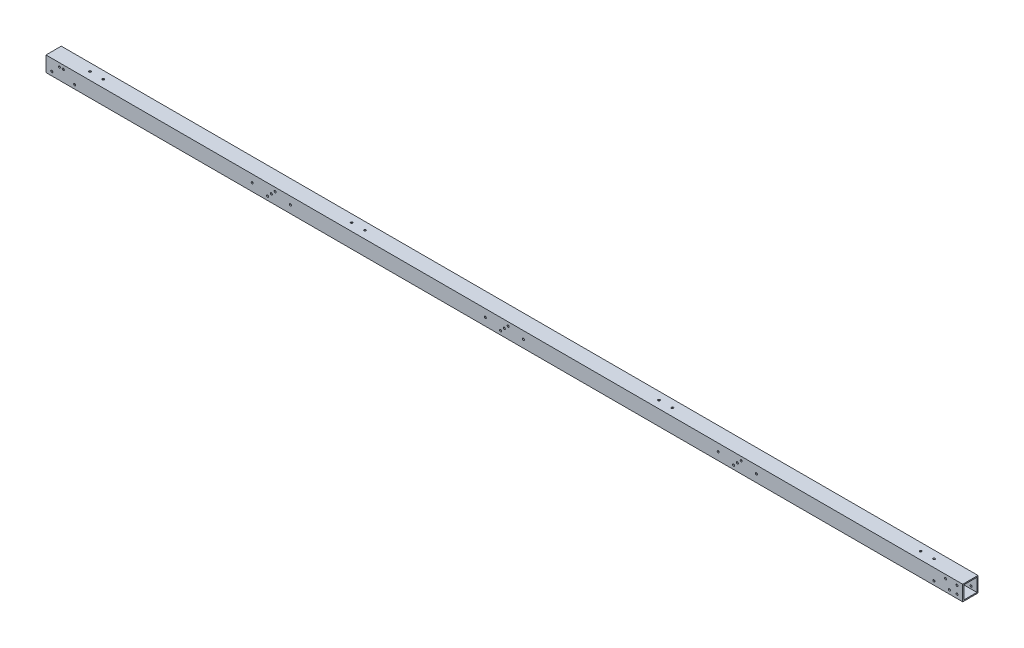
ISO-10303-21;
HEADER;
FILE_DESCRIPTION(('STEP AP214'),'2;1');
FILE_NAME('part.step','',(''),(''),'','','');
FILE_SCHEMA(('AUTOMOTIVE_DESIGN { 1 0 10303 214 1 1 1 1 }'));
ENDSEC;
DATA;
#1=APPLICATION_CONTEXT('core data for automotive mechanical design processes');
#2=APPLICATION_PROTOCOL_DEFINITION('international standard','automotive_design',2000,#1);
#3=PRODUCT_CONTEXT('',#1,'mechanical');
#4=PRODUCT('Part','Part','',(#3));
#5=PRODUCT_RELATED_PRODUCT_CATEGORY('part','',(#4));
#6=PRODUCT_DEFINITION_FORMATION('','',#4);
#7=PRODUCT_DEFINITION_CONTEXT('part definition',#1,'design');
#8=PRODUCT_DEFINITION('design','',#6,#7);
#9=PRODUCT_DEFINITION_SHAPE('','',#8);
#10=(LENGTH_UNIT() NAMED_UNIT(*) SI_UNIT(.MILLI.,.METRE.));
#11=(NAMED_UNIT(*) PLANE_ANGLE_UNIT() SI_UNIT($,.RADIAN.));
#12=(NAMED_UNIT(*) SI_UNIT($,.STERADIAN.) SOLID_ANGLE_UNIT());
#13=UNCERTAINTY_MEASURE_WITH_UNIT(LENGTH_MEASURE(1.E-05),#10,'distance_accuracy_value','');
#14=(GEOMETRIC_REPRESENTATION_CONTEXT(3) GLOBAL_UNCERTAINTY_ASSIGNED_CONTEXT((#13)) GLOBAL_UNIT_ASSIGNED_CONTEXT((#10,
#11,#12)) REPRESENTATION_CONTEXT('',''));
#15=CARTESIAN_POINT('',(0.,0.,0.));
#16=DIRECTION('',(0.,0.,1.));
#17=DIRECTION('',(1.,0.,0.));
#18=AXIS2_PLACEMENT_3D('',#15,#16,#17);
#19=CARTESIAN_POINT('',(3048.,50.8,0.));
#20=DIRECTION('',(-1.,0.,0.));
#21=DIRECTION('',(0.,0.,1.));
#22=AXIS2_PLACEMENT_3D('',#19,#20,#21);
#23=PLANE('',#22);
#24=DIRECTION('',(0.,-1.,0.));
#25=VECTOR('',#24,1.);
#26=CARTESIAN_POINT('',(3048.,0.,0.));
#27=LINE('',#26,#25);
#28=CARTESIAN_POINT('',(3048.,50.8,0.));
#29=VERTEX_POINT('',#28);
#30=CARTESIAN_POINT('',(3048.,0.,0.));
#31=VERTEX_POINT('',#30);
#32=EDGE_CURVE('E300',#29,#31,#27,.T.);
#33=ORIENTED_EDGE('',*,*,#32,.T.);
#34=DIRECTION('',(0.,0.,-1.));
#35=VECTOR('',#34,1.);
#36=CARTESIAN_POINT('',(3048.,0.,0.));
#37=LINE('',#36,#35);
#38=CARTESIAN_POINT('',(3048.,0.,-50.8000000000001));
#39=VERTEX_POINT('',#38);
#40=EDGE_CURVE('E303',#31,#39,#37,.T.);
#41=ORIENTED_EDGE('',*,*,#40,.T.);
#42=DIRECTION('',(0.,1.,0.));
#43=VECTOR('',#42,1.);
#44=CARTESIAN_POINT('',(3048.,0.,-50.8000000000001));
#45=LINE('',#44,#43);
#46=CARTESIAN_POINT('',(3048.,50.8,-50.8000000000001));
#47=VERTEX_POINT('',#46);
#48=EDGE_CURVE('E306',#39,#47,#45,.T.);
#49=ORIENTED_EDGE('',*,*,#48,.T.);
#50=DIRECTION('',(0.,0.,1.));
#51=VECTOR('',#50,1.);
#52=CARTESIAN_POINT('',(3048.,50.8,0.));
#53=LINE('',#52,#51);
#54=EDGE_CURVE('E308',#47,#29,#53,.T.);
#55=ORIENTED_EDGE('',*,*,#54,.T.);
#56=EDGE_LOOP('',(#33,#41,#49,#55));
#57=FACE_BOUND('',#56,.T.);
#58=DIRECTION('',(0.,-1.,0.));
#59=VECTOR('',#58,1.);
#60=CARTESIAN_POINT('',(3048.,47.1424,-3.65760000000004));
#61=LINE('',#60,#59);
#62=CARTESIAN_POINT('',(3048.,47.1424,-3.65760000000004));
#63=VERTEX_POINT('',#62);
#64=CARTESIAN_POINT('',(3048.,3.65759999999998,-3.65760000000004));
#65=VERTEX_POINT('',#64);
#66=EDGE_CURVE('E269',#63,#65,#61,.T.);
#67=ORIENTED_EDGE('',*,*,#66,.F.);
#68=DIRECTION('',(0.,0.,1.));
#69=VECTOR('',#68,1.);
#70=CARTESIAN_POINT('',(3048.,47.1424,-3.65760000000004));
#71=LINE('',#70,#69);
#72=CARTESIAN_POINT('',(3048.,47.1424,-47.1423999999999));
#73=VERTEX_POINT('',#72);
#74=EDGE_CURVE('E277',#73,#63,#71,.T.);
#75=ORIENTED_EDGE('',*,*,#74,.F.);
#76=DIRECTION('',(0.,1.,0.));
#77=VECTOR('',#76,1.);
#78=CARTESIAN_POINT('',(3048.,47.1424,-47.1423999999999));
#79=LINE('',#78,#77);
#80=CARTESIAN_POINT('',(3048.,3.65759999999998,-47.1423999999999));
#81=VERTEX_POINT('',#80);
#82=EDGE_CURVE('E274',#81,#73,#79,.T.);
#83=ORIENTED_EDGE('',*,*,#82,.F.);
#84=DIRECTION('',(0.,0.,-1.));
#85=VECTOR('',#84,1.);
#86=CARTESIAN_POINT('',(3048.,3.65759999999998,-3.65760000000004));
#87=LINE('',#86,#85);
#88=EDGE_CURVE('E271',#65,#81,#87,.T.);
#89=ORIENTED_EDGE('',*,*,#88,.F.);
#90=EDGE_LOOP('',(#67,#75,#83,#89));
#91=FACE_BOUND('',#90,.T.);
#92=ADVANCED_FACE('F30',(#57,#91),#23,.F.);
#93=CARTESIAN_POINT('',(0.,50.8,0.));
#94=DIRECTION('',(-1.,0.,0.));
#95=DIRECTION('',(0.,0.,1.));
#96=AXIS2_PLACEMENT_3D('',#93,#94,#95);
#97=PLANE('',#96);
#98=DIRECTION('',(0.,-1.,0.));
#99=VECTOR('',#98,1.);
#100=CARTESIAN_POINT('',(0.,0.,0.));
#101=LINE('',#100,#99);
#102=CARTESIAN_POINT('',(0.,50.8,0.));
#103=VERTEX_POINT('',#102);
#104=CARTESIAN_POINT('',(0.,0.,0.));
#105=VERTEX_POINT('',#104);
#106=EDGE_CURVE('E299',#103,#105,#101,.T.);
#107=ORIENTED_EDGE('',*,*,#106,.F.);
#108=DIRECTION('',(0.,0.,1.));
#109=VECTOR('',#108,1.);
#110=CARTESIAN_POINT('',(0.,50.8,0.));
#111=LINE('',#110,#109);
#112=CARTESIAN_POINT('',(0.,50.8,-50.8000000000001));
#113=VERTEX_POINT('',#112);
#114=EDGE_CURVE('E304',#113,#103,#111,.T.);
#115=ORIENTED_EDGE('',*,*,#114,.F.);
#116=DIRECTION('',(0.,1.,0.));
#117=VECTOR('',#116,1.);
#118=CARTESIAN_POINT('',(0.,0.,-50.8000000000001));
#119=LINE('',#118,#117);
#120=CARTESIAN_POINT('',(0.,0.,-50.8000000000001));
#121=VERTEX_POINT('',#120);
#122=EDGE_CURVE('E315',#121,#113,#119,.T.);
#123=ORIENTED_EDGE('',*,*,#122,.F.);
#124=DIRECTION('',(0.,0.,-1.));
#125=VECTOR('',#124,1.);
#126=CARTESIAN_POINT('',(0.,0.,0.));
#127=LINE('',#126,#125);
#128=EDGE_CURVE('E313',#105,#121,#127,.T.);
#129=ORIENTED_EDGE('',*,*,#128,.F.);
#130=EDGE_LOOP('',(#107,#115,#123,#129));
#131=FACE_BOUND('',#130,.T.);
#132=DIRECTION('',(0.,0.,1.));
#133=VECTOR('',#132,1.);
#134=CARTESIAN_POINT('',(0.,47.1424,-3.65760000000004));
#135=LINE('',#134,#133);
#136=CARTESIAN_POINT('',(0.,47.1424,-47.1423999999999));
#137=VERTEX_POINT('',#136);
#138=CARTESIAN_POINT('',(0.,47.1424,-3.65760000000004));
#139=VERTEX_POINT('',#138);
#140=EDGE_CURVE('E272',#137,#139,#135,.T.);
#141=ORIENTED_EDGE('',*,*,#140,.T.);
#142=DIRECTION('',(0.,-1.,0.));
#143=VECTOR('',#142,1.);
#144=CARTESIAN_POINT('',(0.,47.1424,-3.65760000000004));
#145=LINE('',#144,#143);
#146=CARTESIAN_POINT('',(0.,3.65759999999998,-3.65760000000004));
#147=VERTEX_POINT('',#146);
#148=EDGE_CURVE('E268',#139,#147,#145,.T.);
#149=ORIENTED_EDGE('',*,*,#148,.T.);
#150=DIRECTION('',(0.,0.,-1.));
#151=VECTOR('',#150,1.);
#152=CARTESIAN_POINT('',(0.,3.65759999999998,-3.65760000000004));
#153=LINE('',#152,#151);
#154=CARTESIAN_POINT('',(0.,3.65759999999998,-47.1423999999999));
#155=VERTEX_POINT('',#154);
#156=EDGE_CURVE('E282',#147,#155,#153,.T.);
#157=ORIENTED_EDGE('',*,*,#156,.T.);
#158=DIRECTION('',(0.,1.,0.));
#159=VECTOR('',#158,1.);
#160=CARTESIAN_POINT('',(0.,47.1424,-47.1423999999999));
#161=LINE('',#160,#159);
#162=EDGE_CURVE('E285',#155,#137,#161,.T.);
#163=ORIENTED_EDGE('',*,*,#162,.T.);
#164=EDGE_LOOP('',(#141,#149,#157,#163));
#165=FACE_BOUND('',#164,.T.);
#166=ADVANCED_FACE('F745',(#131,#165),#97,.T.);
#167=CARTESIAN_POINT('',(3048.,0.,0.));
#168=DIRECTION('',(0.,0.,-1.));
#169=DIRECTION('',(-1.,0.,0.));
#170=AXIS2_PLACEMENT_3D('',#167,#168,#169);
#171=PLANE('',#170);
#172=CARTESIAN_POINT('',(3028.95,38.1000000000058,0.));
#173=DIRECTION('',(0.,0.,-1.));
#174=DIRECTION('',(-1.,0.,0.));
#175=AXIS2_PLACEMENT_3D('',#172,#173,#174);
#176=CIRCLE('',#175,3.37312000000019);
#177=CARTESIAN_POINT('',(3025.57688,38.1000000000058,0.));
#178=VERTEX_POINT('',#177);
#179=EDGE_CURVE('E445',#178,#178,#176,.T.);
#180=ORIENTED_EDGE('',*,*,#179,.T.);
#181=EDGE_LOOP('',(#180));
#182=FACE_BOUND('',#181,.T.);
#183=CARTESIAN_POINT('',(3003.55,12.7000000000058,0.));
#184=DIRECTION('',(0.,0.,-1.));
#185=DIRECTION('',(-1.,0.,0.));
#186=AXIS2_PLACEMENT_3D('',#183,#184,#185);
#187=CIRCLE('',#186,3.3731200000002);
#188=CARTESIAN_POINT('',(3000.17688,12.7000000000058,0.));
#189=VERTEX_POINT('',#188);
#190=EDGE_CURVE('E440',#189,#189,#187,.T.);
#191=ORIENTED_EDGE('',*,*,#190,.T.);
#192=EDGE_LOOP('',(#191));
#193=FACE_BOUND('',#192,.T.);
#194=CARTESIAN_POINT('',(44.4499999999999,38.1000000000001,0.));
#195=DIRECTION('',(0.,0.,-1.));
#196=DIRECTION('',(-1.,0.,0.));
#197=AXIS2_PLACEMENT_3D('',#194,#195,#196);
#198=CIRCLE('',#197,3.37312);
#199=CARTESIAN_POINT('',(41.0768799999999,38.1000000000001,0.));
#200=VERTEX_POINT('',#199);
#201=EDGE_CURVE('E435',#200,#200,#198,.T.);
#202=ORIENTED_EDGE('',*,*,#201,.T.);
#203=EDGE_LOOP('',(#202));
#204=FACE_BOUND('',#203,.T.);
#205=CARTESIAN_POINT('',(1511.24656381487,12.7000000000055,0.));
#206=DIRECTION('',(0.,0.,-1.));
#207=DIRECTION('',(-1.,0.,0.));
#208=AXIS2_PLACEMENT_3D('',#205,#206,#207);
#209=CIRCLE('',#208,3.37311999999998);
#210=CARTESIAN_POINT('',(1507.87344381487,12.7000000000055,0.));
#211=VERTEX_POINT('',#210);
#212=EDGE_CURVE('E413',#211,#211,#209,.T.);
#213=ORIENTED_EDGE('',*,*,#212,.T.);
#214=EDGE_LOOP('',(#213));
#215=FACE_BOUND('',#214,.T.);
#216=CARTESIAN_POINT('',(1536.7,38.1000000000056,0.));
#217=DIRECTION('',(0.,0.,-1.));
#218=DIRECTION('',(-1.,0.,0.));
#219=AXIS2_PLACEMENT_3D('',#216,#217,#218);
#220=CIRCLE('',#219,3.37311999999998);
#221=CARTESIAN_POINT('',(1533.32688,38.1000000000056,0.));
#222=VERTEX_POINT('',#221);
#223=EDGE_CURVE('E408',#222,#222,#220,.T.);
#224=ORIENTED_EDGE('',*,*,#223,.T.);
#225=EDGE_LOOP('',(#224));
#226=FACE_BOUND('',#225,.T.);
#227=CARTESIAN_POINT('',(2286.05343618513,12.6999999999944,0.));
#228=DIRECTION('',(0.,0.,-1.));
#229=DIRECTION('',(-1.,0.,0.));
#230=AXIS2_PLACEMENT_3D('',#227,#228,#229);
#231=CIRCLE('',#230,3.37312000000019);
#232=CARTESIAN_POINT('',(2282.68031618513,12.6999999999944,0.));
#233=VERTEX_POINT('',#232);
#234=EDGE_CURVE('E403',#233,#233,#231,.T.);
#235=ORIENTED_EDGE('',*,*,#234,.T.);
#236=EDGE_LOOP('',(#235));
#237=FACE_BOUND('',#236,.T.);
#238=CARTESIAN_POINT('',(2311.45343618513,38.0999999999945,0.));
#239=DIRECTION('',(0.,0.,-1.));
#240=DIRECTION('',(-1.,0.,0.));
#241=AXIS2_PLACEMENT_3D('',#238,#239,#240);
#242=CIRCLE('',#241,3.37312000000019);
#243=CARTESIAN_POINT('',(2308.08031618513,38.0999999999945,0.));
#244=VERTEX_POINT('',#243);
#245=EDGE_CURVE('E398',#244,#244,#242,.T.);
#246=ORIENTED_EDGE('',*,*,#245,.T.);
#247=EDGE_LOOP('',(#246));
#248=FACE_BOUND('',#247,.T.);
#249=CARTESIAN_POINT('',(762.053436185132,38.0999999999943,0.));
#250=DIRECTION('',(0.,0.,-1.));
#251=DIRECTION('',(-1.,0.,0.));
#252=AXIS2_PLACEMENT_3D('',#249,#250,#251);
#253=CIRCLE('',#252,3.37311999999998);
#254=CARTESIAN_POINT('',(758.680316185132,38.0999999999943,0.));
#255=VERTEX_POINT('',#254);
#256=EDGE_CURVE('E393',#255,#255,#253,.T.);
#257=ORIENTED_EDGE('',*,*,#256,.T.);
#258=EDGE_LOOP('',(#257));
#259=FACE_BOUND('',#258,.T.);
#260=CARTESIAN_POINT('',(736.653436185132,12.6999999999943,0.));
#261=DIRECTION('',(0.,0.,-1.));
#262=DIRECTION('',(-1.,0.,0.));
#263=AXIS2_PLACEMENT_3D('',#260,#261,#262);
#264=CIRCLE('',#263,3.37311999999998);
#265=CARTESIAN_POINT('',(733.280316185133,12.6999999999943,0.));
#266=VERTEX_POINT('',#265);
#267=EDGE_CURVE('E388',#266,#266,#264,.T.);
#268=ORIENTED_EDGE('',*,*,#267,.T.);
#269=EDGE_LOOP('',(#268));
#270=FACE_BOUND('',#269,.T.);
#271=CARTESIAN_POINT('',(1587.55343618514,25.3999999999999,0.));
#272=DIRECTION('',(0.,0.,-1.));
#273=DIRECTION('',(-1.,0.,0.));
#274=AXIS2_PLACEMENT_3D('',#271,#272,#273);
#275=CIRCLE('',#274,3.37311999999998);
#276=CARTESIAN_POINT('',(1584.18031618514,25.3999999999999,0.));
#277=VERTEX_POINT('',#276);
#278=EDGE_CURVE('E383',#277,#277,#275,.T.);
#279=ORIENTED_EDGE('',*,*,#278,.T.);
#280=EDGE_LOOP('',(#279));
#281=FACE_BOUND('',#280,.T.);
#282=CARTESIAN_POINT('',(1460.55343618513,25.3999999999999,0.));
#283=DIRECTION('',(0.,0.,-1.));
#284=DIRECTION('',(-1.,0.,0.));
#285=AXIS2_PLACEMENT_3D('',#282,#283,#284);
#286=CIRCLE('',#285,3.37311999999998);
#287=CARTESIAN_POINT('',(1457.18031618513,25.3999999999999,0.));
#288=VERTEX_POINT('',#287);
#289=EDGE_CURVE('E378',#288,#288,#286,.T.);
#290=ORIENTED_EDGE('',*,*,#289,.T.);
#291=EDGE_LOOP('',(#290));
#292=FACE_BOUND('',#291,.T.);
#293=CARTESIAN_POINT('',(1524.05343618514,25.3999999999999,0.));
#294=DIRECTION('',(0.,0.,-1.));
#295=DIRECTION('',(-1.,0.,0.));
#296=AXIS2_PLACEMENT_3D('',#293,#294,#295);
#297=CIRCLE('',#296,3.37311999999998);
#298=CARTESIAN_POINT('',(1520.68031618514,25.3999999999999,0.));
#299=VERTEX_POINT('',#298);
#300=EDGE_CURVE('E373',#299,#299,#297,.T.);
#301=ORIENTED_EDGE('',*,*,#300,.T.);
#302=EDGE_LOOP('',(#301));
#303=FACE_BOUND('',#302,.T.);
#304=CARTESIAN_POINT('',(685.746563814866,25.4,0.));
#305=DIRECTION('',(0.,0.,-1.));
#306=DIRECTION('',(-1.,0.,0.));
#307=AXIS2_PLACEMENT_3D('',#304,#305,#306);
#308=CIRCLE('',#307,3.37312000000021);
#309=CARTESIAN_POINT('',(682.373443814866,25.4,0.));
#310=VERTEX_POINT('',#309);
#311=EDGE_CURVE('E368',#310,#310,#308,.T.);
#312=ORIENTED_EDGE('',*,*,#311,.T.);
#313=EDGE_LOOP('',(#312));
#314=FACE_BOUND('',#313,.T.);
#315=CARTESIAN_POINT('',(749.246563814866,25.4,0.));
#316=DIRECTION('',(0.,0.,-1.));
#317=DIRECTION('',(-1.,0.,0.));
#318=AXIS2_PLACEMENT_3D('',#315,#316,#317);
#319=CIRCLE('',#318,3.37312000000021);
#320=CARTESIAN_POINT('',(745.873443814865,25.4,0.));
#321=VERTEX_POINT('',#320);
#322=EDGE_CURVE('E363',#321,#321,#319,.T.);
#323=ORIENTED_EDGE('',*,*,#322,.T.);
#324=EDGE_LOOP('',(#323));
#325=FACE_BOUND('',#324,.T.);
#326=CARTESIAN_POINT('',(812.746563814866,25.4,0.));
#327=DIRECTION('',(0.,0.,-1.));
#328=DIRECTION('',(-1.,0.,0.));
#329=AXIS2_PLACEMENT_3D('',#326,#327,#328);
#330=CIRCLE('',#329,3.37312000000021);
#331=CARTESIAN_POINT('',(809.373443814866,25.4,0.));
#332=VERTEX_POINT('',#331);
#333=EDGE_CURVE('E358',#332,#332,#330,.T.);
#334=ORIENTED_EDGE('',*,*,#333,.T.);
#335=EDGE_LOOP('',(#334));
#336=FACE_BOUND('',#335,.T.);
#337=CARTESIAN_POINT('',(2362.14656381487,25.4000000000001,0.));
#338=DIRECTION('',(0.,0.,-1.));
#339=DIRECTION('',(-1.,0.,0.));
#340=AXIS2_PLACEMENT_3D('',#337,#338,#339);
#341=CIRCLE('',#340,3.3731200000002);
#342=CARTESIAN_POINT('',(2358.77344381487,25.4000000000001,0.));
#343=VERTEX_POINT('',#342);
#344=EDGE_CURVE('E353',#343,#343,#341,.T.);
#345=ORIENTED_EDGE('',*,*,#344,.T.);
#346=EDGE_LOOP('',(#345));
#347=FACE_BOUND('',#346,.T.);
#348=CARTESIAN_POINT('',(2298.64656381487,25.4000000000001,0.));
#349=DIRECTION('',(0.,0.,-1.));
#350=DIRECTION('',(-1.,0.,0.));
#351=AXIS2_PLACEMENT_3D('',#348,#349,#350);
#352=CIRCLE('',#351,3.3731200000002);
#353=CARTESIAN_POINT('',(2295.27344381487,25.4000000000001,0.));
#354=VERTEX_POINT('',#353);
#355=EDGE_CURVE('E348',#354,#354,#352,.T.);
#356=ORIENTED_EDGE('',*,*,#355,.T.);
#357=EDGE_LOOP('',(#356));
#358=FACE_BOUND('',#357,.T.);
#359=CARTESIAN_POINT('',(2235.14656381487,25.4000000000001,0.));
#360=DIRECTION('',(0.,0.,-1.));
#361=DIRECTION('',(-1.,0.,0.));
#362=AXIS2_PLACEMENT_3D('',#359,#360,#361);
#363=CIRCLE('',#362,3.3731200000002);
#364=CARTESIAN_POINT('',(2231.77344381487,25.4000000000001,0.));
#365=VERTEX_POINT('',#364);
#366=EDGE_CURVE('E343',#365,#365,#363,.T.);
#367=ORIENTED_EDGE('',*,*,#366,.T.);
#368=EDGE_LOOP('',(#367));
#369=FACE_BOUND('',#368,.T.);
#370=CARTESIAN_POINT('',(2952.21961036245,12.3324242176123,0.));
#371=DIRECTION('',(0.,0.,-1.));
#372=DIRECTION('',(-1.,0.,0.));
#373=AXIS2_PLACEMENT_3D('',#370,#371,#372);
#374=CIRCLE('',#373,3.3731200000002);
#375=CARTESIAN_POINT('',(2954.6604791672,10.0043138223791,0.));
#376=VERTEX_POINT('',#375);
#377=CARTESIAN_POINT('',(2950.89665628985,15.4352827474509,0.));
#378=VERTEX_POINT('',#377);
#379=EDGE_CURVE('E200',#376,#378,#374,.T.);
#380=ORIENTED_EDGE('',*,*,#379,.T.);
#381=CARTESIAN_POINT('',(2952.75000000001,12.7,0.));
#382=DIRECTION('',(0.,0.,1.));
#383=DIRECTION('',(-1.,0.,0.));
#384=AXIS2_PLACEMENT_3D('',#381,#382,#383);
#385=CIRCLE('',#384,3.3040361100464);
#386=EDGE_CURVE('E55',#376,#378,#385,.T.);
#387=ORIENTED_EDGE('',*,*,#386,.F.);
#388=EDGE_LOOP('',(#380,#387));
#389=FACE_BOUND('',#388,.T.);
#390=CARTESIAN_POINT('',(3028.95,12.7,0.));
#391=DIRECTION('',(0.,0.,-1.));
#392=DIRECTION('',(1.,0.,0.));
#393=AXIS2_PLACEMENT_3D('',#390,#391,#392);
#394=CIRCLE('',#393,3.37312000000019);
#395=CARTESIAN_POINT('',(3032.32312,12.7,0.));
#396=VERTEX_POINT('',#395);
#397=EDGE_CURVE('E219',#396,#396,#394,.T.);
#398=ORIENTED_EDGE('',*,*,#397,.T.);
#399=EDGE_LOOP('',(#398));
#400=FACE_BOUND('',#399,.T.);
#401=CARTESIAN_POINT('',(2990.85,38.1,0.));
#402=DIRECTION('',(0.,0.,-1.));
#403=DIRECTION('',(1.,0.,0.));
#404=AXIS2_PLACEMENT_3D('',#401,#402,#403);
#405=CIRCLE('',#404,3.37312000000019);
#406=CARTESIAN_POINT('',(2994.22312,38.1,0.));
#407=VERTEX_POINT('',#406);
#408=EDGE_CURVE('E229',#407,#407,#405,.T.);
#409=ORIENTED_EDGE('',*,*,#408,.T.);
#410=EDGE_LOOP('',(#409));
#411=FACE_BOUND('',#410,.T.);
#412=CARTESIAN_POINT('',(95.6187627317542,12.3324242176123,0.));
#413=DIRECTION('',(0.,0.,-1.));
#414=DIRECTION('',(1.,0.,0.));
#415=AXIS2_PLACEMENT_3D('',#412,#413,#414);
#416=CIRCLE('',#415,3.3731200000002);
#417=CARTESIAN_POINT('',(97.4496201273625,15.1654261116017,0.));
#418=VERTEX_POINT('',#417);
#419=CARTESIAN_POINT('',(92.7916780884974,10.4924429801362,0.));
#420=VERTEX_POINT('',#419);
#421=EDGE_CURVE('E239',#418,#420,#416,.T.);
#422=ORIENTED_EDGE('',*,*,#421,.T.);
#423=CARTESIAN_POINT('',(95.2499999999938,12.7,0.));
#424=DIRECTION('',(0.,0.,1.));
#425=DIRECTION('',(1.,0.,0.));
#426=AXIS2_PLACEMENT_3D('',#423,#424,#425);
#427=CIRCLE('',#426,3.30403611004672);
#428=EDGE_CURVE('E596',#418,#420,#427,.T.);
#429=ORIENTED_EDGE('',*,*,#428,.F.);
#430=EDGE_LOOP('',(#422,#429));
#431=FACE_BOUND('',#430,.T.);
#432=CARTESIAN_POINT('',(19.4203768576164,12.8283981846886,0.));
#433=DIRECTION('',(0.,0.,-1.));
#434=DIRECTION('',(-1.,0.,0.));
#435=AXIS2_PLACEMENT_3D('',#432,#433,#434);
#436=CIRCLE('',#435,3.37312000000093);
#437=CARTESIAN_POINT('',(17.6047123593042,15.671161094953,0.));
#438=VERTEX_POINT('',#437);
#439=CARTESIAN_POINT('',(19.7538383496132,9.47180140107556,0.));
#440=VERTEX_POINT('',#439);
#441=EDGE_CURVE('E249',#438,#440,#436,.T.);
#442=ORIENTED_EDGE('',*,*,#441,.T.);
#443=CARTESIAN_POINT('',(19.0499999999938,12.7,0.));
#444=DIRECTION('',(0.,0.,1.));
#445=DIRECTION('',(1.,0.,0.));
#446=AXIS2_PLACEMENT_3D('',#443,#444,#445);
#447=CIRCLE('',#446,3.3040361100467);
#448=EDGE_CURVE('E566',#438,#440,#447,.T.);
#449=ORIENTED_EDGE('',*,*,#448,.F.);
#450=EDGE_LOOP('',(#442,#449));
#451=FACE_BOUND('',#450,.T.);
#452=CARTESIAN_POINT('',(57.6848944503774,37.9798731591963,0.));
#453=DIRECTION('',(0.,0.,-1.));
#454=DIRECTION('',(-1.,0.,0.));
#455=AXIS2_PLACEMENT_3D('',#452,#453,#454);
#456=CIRCLE('',#455,3.37312000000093);
#457=CARTESIAN_POINT('',(57.0246592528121,41.2877467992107,0.));
#458=VERTEX_POINT('',#457);
#459=CARTESIAN_POINT('',(55.6736323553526,35.2719656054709,0.));
#460=VERTEX_POINT('',#459);
#461=EDGE_CURVE('E259',#458,#460,#456,.T.);
#462=ORIENTED_EDGE('',*,*,#461,.T.);
#463=CARTESIAN_POINT('',(57.1499999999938,38.1,0.));
#464=DIRECTION('',(0.,0.,1.));
#465=DIRECTION('',(1.,0.,0.));
#466=AXIS2_PLACEMENT_3D('',#463,#464,#465);
#467=CIRCLE('',#466,3.19021001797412);
#468=EDGE_CURVE('E581',#458,#460,#467,.T.);
#469=ORIENTED_EDGE('',*,*,#468,.F.);
#470=EDGE_LOOP('',(#462,#469));
#471=FACE_BOUND('',#470,.T.);
#472=ORIENTED_EDGE('',*,*,#106,.T.);
#473=DIRECTION('',(-1.,0.,0.));
#474=VECTOR('',#473,1.);
#475=CARTESIAN_POINT('',(3048.,0.,0.));
#476=LINE('',#475,#474);
#477=EDGE_CURVE('E326',#31,#105,#476,.T.);
#478=ORIENTED_EDGE('',*,*,#477,.F.);
#479=ORIENTED_EDGE('',*,*,#32,.F.);
#480=DIRECTION('',(-1.,0.,0.));
#481=VECTOR('',#480,1.);
#482=CARTESIAN_POINT('',(3048.,50.8,0.));
#483=LINE('',#482,#481);
#484=EDGE_CURVE('E310',#29,#103,#483,.T.);
#485=ORIENTED_EDGE('',*,*,#484,.T.);
#486=EDGE_LOOP('',(#472,#478,#479,#485));
#487=FACE_BOUND('',#486,.T.);
#488=ADVANCED_FACE('F32',(#182,#193,#204,#215,#226,#237,#248,#259,#270,#281,#292,#303,#314,#325,
#336,#347,#358,#369,#389,#400,#411,#431,#451,#471,#487),#171,.F.);
#489=CARTESIAN_POINT('',(3048.,0.,0.));
#490=DIRECTION('',(0.,1.,0.));
#491=DIRECTION('',(0.,0.,1.));
#492=AXIS2_PLACEMENT_3D('',#489,#490,#491);
#493=PLANE('',#492);
#494=CARTESIAN_POINT('',(2882.97172123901,0.,-25.4000011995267));
#495=DIRECTION('',(0.,-1.,0.));
#496=DIRECTION('',(0.,0.,-1.));
#497=AXIS2_PLACEMENT_3D('',#494,#495,#496);
#498=CIRCLE('',#497,3.3731200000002);
#499=CARTESIAN_POINT('',(2882.97172123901,0.,-28.7731211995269));
#500=VERTEX_POINT('',#499);
#501=EDGE_CURVE('E1527',#500,#500,#498,.T.);
#502=ORIENTED_EDGE('',*,*,#501,.F.);
#503=EDGE_LOOP('',(#502));
#504=FACE_BOUND('',#503,.T.);
#505=CARTESIAN_POINT('',(2927.35,0.,-25.4000000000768));
#506=DIRECTION('',(0.,-1.,0.));
#507=DIRECTION('',(0.,0.,-1.));
#508=AXIS2_PLACEMENT_3D('',#505,#506,#507);
#509=CIRCLE('',#508,3.3731200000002);
#510=CARTESIAN_POINT('',(2927.35,0.,-28.773120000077));
#511=VERTEX_POINT('',#510);
#512=EDGE_CURVE('E485',#511,#511,#509,.T.);
#513=ORIENTED_EDGE('',*,*,#512,.F.);
#514=EDGE_LOOP('',(#513));
#515=FACE_BOUND('',#514,.T.);
#516=CARTESIAN_POINT('',(2012.95,0.,-25.4000000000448));
#517=DIRECTION('',(0.,-1.,0.));
#518=DIRECTION('',(0.,0.,-1.));
#519=AXIS2_PLACEMENT_3D('',#516,#517,#518);
#520=CIRCLE('',#519,3.3731200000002);
#521=CARTESIAN_POINT('',(2012.95,0.,-28.773120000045));
#522=VERTEX_POINT('',#521);
#523=EDGE_CURVE('E482',#522,#522,#520,.T.);
#524=ORIENTED_EDGE('',*,*,#523,.F.);
#525=EDGE_LOOP('',(#524));
#526=FACE_BOUND('',#525,.T.);
#527=CARTESIAN_POINT('',(2057.25655595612,0.,-25.4000011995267));
#528=DIRECTION('',(0.,-1.,0.));
#529=DIRECTION('',(0.,0.,-1.));
#530=AXIS2_PLACEMENT_3D('',#527,#528,#529);
#531=CIRCLE('',#530,3.3731200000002);
#532=CARTESIAN_POINT('',(2057.25655595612,0.,-28.7731211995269));
#533=VERTEX_POINT('',#532);
#534=EDGE_CURVE('E501',#533,#533,#531,.T.);
#535=ORIENTED_EDGE('',*,*,#534,.F.);
#536=EDGE_LOOP('',(#535));
#537=FACE_BOUND('',#536,.T.);
#538=CARTESIAN_POINT('',(990.815166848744,0.,-25.4000011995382));
#539=DIRECTION('',(0.,-1.,0.));
#540=DIRECTION('',(0.,0.,-1.));
#541=AXIS2_PLACEMENT_3D('',#538,#539,#540);
#542=CIRCLE('',#541,3.37311999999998);
#543=CARTESIAN_POINT('',(990.815166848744,0.,-28.7731211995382));
#544=VERTEX_POINT('',#543);
#545=EDGE_CURVE('E508',#544,#544,#542,.T.);
#546=ORIENTED_EDGE('',*,*,#545,.F.);
#547=EDGE_LOOP('',(#546));
#548=FACE_BOUND('',#547,.T.);
#549=CARTESIAN_POINT('',(1035.12172280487,0.,-25.4000000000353));
#550=DIRECTION('',(0.,-1.,0.));
#551=DIRECTION('',(0.,0.,-1.));
#552=AXIS2_PLACEMENT_3D('',#549,#550,#551);
#553=CIRCLE('',#552,3.37311999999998);
#554=CARTESIAN_POINT('',(1035.12172280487,0.,-28.7731200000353));
#555=VERTEX_POINT('',#554);
#556=EDGE_CURVE('E515',#555,#555,#553,.T.);
#557=ORIENTED_EDGE('',*,*,#556,.F.);
#558=EDGE_LOOP('',(#557));
#559=FACE_BOUND('',#558,.T.);
#560=CARTESIAN_POINT('',(120.721722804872,0.,-25.400000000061));
#561=DIRECTION('',(0.,-1.,0.));
#562=DIRECTION('',(0.,0.,-1.));
#563=AXIS2_PLACEMENT_3D('',#560,#561,#562);
#564=CIRCLE('',#563,3.37312000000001);
#565=CARTESIAN_POINT('',(120.721722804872,0.,-28.7731200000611));
#566=VERTEX_POINT('',#565);
#567=EDGE_CURVE('E522',#566,#566,#564,.T.);
#568=ORIENTED_EDGE('',*,*,#567,.F.);
#569=EDGE_LOOP('',(#568));
#570=FACE_BOUND('',#569,.T.);
#571=CARTESIAN_POINT('',(165.028278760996,0.,-25.400001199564));
#572=DIRECTION('',(0.,-1.,0.));
#573=DIRECTION('',(0.,0.,-1.));
#574=AXIS2_PLACEMENT_3D('',#571,#572,#573);
#575=CIRCLE('',#574,3.37312000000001);
#576=CARTESIAN_POINT('',(165.028278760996,0.,-28.773121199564));
#577=VERTEX_POINT('',#576);
#578=EDGE_CURVE('E529',#577,#577,#575,.T.);
#579=ORIENTED_EDGE('',*,*,#578,.F.);
#580=EDGE_LOOP('',(#579));
#581=FACE_BOUND('',#580,.T.);
#582=ORIENTED_EDGE('',*,*,#128,.T.);
#583=DIRECTION('',(-1.,0.,0.));
#584=VECTOR('',#583,1.);
#585=CARTESIAN_POINT('',(3048.,0.,-50.8000000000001));
#586=LINE('',#585,#584);
#587=EDGE_CURVE('E323',#39,#121,#586,.T.);
#588=ORIENTED_EDGE('',*,*,#587,.F.);
#589=ORIENTED_EDGE('',*,*,#40,.F.);
#590=ORIENTED_EDGE('',*,*,#477,.T.);
#591=EDGE_LOOP('',(#582,#588,#589,#590));
#592=FACE_BOUND('',#591,.T.);
#593=ADVANCED_FACE('F720',(#504,#515,#526,#537,#548,#559,#570,#581,#592),#493,.F.);
#594=CARTESIAN_POINT('',(3048.,0.,-50.8000000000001));
#595=DIRECTION('',(0.,0.,1.));
#596=DIRECTION('',(1.,0.,0.));
#597=AXIS2_PLACEMENT_3D('',#594,#595,#596);
#598=PLANE('',#597);
#599=CARTESIAN_POINT('',(3028.95,38.1000000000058,-50.8000000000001));
#600=DIRECTION('',(0.,0.,-1.));
#601=DIRECTION('',(-1.,0.,0.));
#602=AXIS2_PLACEMENT_3D('',#599,#600,#601);
#603=CIRCLE('',#602,3.37312000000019);
#604=CARTESIAN_POINT('',(3025.57688,38.1000000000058,-50.8000000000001));
#605=VERTEX_POINT('',#604);
#606=EDGE_CURVE('E536',#605,#605,#603,.T.);
#607=ORIENTED_EDGE('',*,*,#606,.F.);
#608=EDGE_LOOP('',(#607));
#609=FACE_BOUND('',#608,.T.);
#610=CARTESIAN_POINT('',(3003.55,12.7000000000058,-50.8000000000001));
#611=DIRECTION('',(0.,0.,-1.));
#612=DIRECTION('',(-1.,0.,0.));
#613=AXIS2_PLACEMENT_3D('',#610,#611,#612);
#614=CIRCLE('',#613,3.3731200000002);
#615=CARTESIAN_POINT('',(3000.17688,12.7000000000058,-50.8000000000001));
#616=VERTEX_POINT('',#615);
#617=EDGE_CURVE('E543',#616,#616,#614,.T.);
#618=ORIENTED_EDGE('',*,*,#617,.F.);
#619=EDGE_LOOP('',(#618));
#620=FACE_BOUND('',#619,.T.);
#621=CARTESIAN_POINT('',(44.4499999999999,38.1000000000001,-50.8000000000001));
#622=DIRECTION('',(0.,0.,-1.));
#623=DIRECTION('',(-1.,0.,0.));
#624=AXIS2_PLACEMENT_3D('',#621,#622,#623);
#625=CIRCLE('',#624,3.37312);
#626=CARTESIAN_POINT('',(41.0768799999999,38.1000000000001,-50.8000000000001));
#627=VERTEX_POINT('',#626);
#628=EDGE_CURVE('E550',#627,#627,#625,.T.);
#629=ORIENTED_EDGE('',*,*,#628,.F.);
#630=EDGE_LOOP('',(#629));
#631=FACE_BOUND('',#630,.T.);
#632=CARTESIAN_POINT('',(1511.24656381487,12.7000000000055,-50.8000000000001));
#633=DIRECTION('',(0.,0.,-1.));
#634=DIRECTION('',(-1.,0.,0.));
#635=AXIS2_PLACEMENT_3D('',#632,#633,#634);
#636=CIRCLE('',#635,3.37311999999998);
#637=CARTESIAN_POINT('',(1507.87344381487,12.7000000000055,-50.8000000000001));
#638=VERTEX_POINT('',#637);
#639=EDGE_CURVE('E611',#638,#638,#636,.T.);
#640=ORIENTED_EDGE('',*,*,#639,.F.);
#641=EDGE_LOOP('',(#640));
#642=FACE_BOUND('',#641,.T.);
#643=CARTESIAN_POINT('',(1536.7,38.1000000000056,-50.8000000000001));
#644=DIRECTION('',(0.,0.,-1.));
#645=DIRECTION('',(-1.,0.,0.));
#646=AXIS2_PLACEMENT_3D('',#643,#644,#645);
#647=CIRCLE('',#646,3.37311999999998);
#648=CARTESIAN_POINT('',(1533.32688,38.1000000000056,-50.8000000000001));
#649=VERTEX_POINT('',#648);
#650=EDGE_CURVE('E618',#649,#649,#647,.T.);
#651=ORIENTED_EDGE('',*,*,#650,.F.);
#652=EDGE_LOOP('',(#651));
#653=FACE_BOUND('',#652,.T.);
#654=CARTESIAN_POINT('',(2286.05343618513,12.6999999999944,-50.8000000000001));
#655=DIRECTION('',(0.,0.,-1.));
#656=DIRECTION('',(-1.,0.,0.));
#657=AXIS2_PLACEMENT_3D('',#654,#655,#656);
#658=CIRCLE('',#657,3.37312000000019);
#659=CARTESIAN_POINT('',(2282.68031618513,12.6999999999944,-50.8000000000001));
#660=VERTEX_POINT('',#659);
#661=EDGE_CURVE('E625',#660,#660,#658,.T.);
#662=ORIENTED_EDGE('',*,*,#661,.F.);
#663=EDGE_LOOP('',(#662));
#664=FACE_BOUND('',#663,.T.);
#665=CARTESIAN_POINT('',(2311.45343618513,38.0999999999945,-50.8000000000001));
#666=DIRECTION('',(0.,0.,-1.));
#667=DIRECTION('',(-1.,0.,0.));
#668=AXIS2_PLACEMENT_3D('',#665,#666,#667);
#669=CIRCLE('',#668,3.37312000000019);
#670=CARTESIAN_POINT('',(2308.08031618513,38.0999999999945,-50.8000000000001));
#671=VERTEX_POINT('',#670);
#672=EDGE_CURVE('E632',#671,#671,#669,.T.);
#673=ORIENTED_EDGE('',*,*,#672,.F.);
#674=EDGE_LOOP('',(#673));
#675=FACE_BOUND('',#674,.T.);
#676=CARTESIAN_POINT('',(762.053436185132,38.0999999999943,-50.8000000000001));
#677=DIRECTION('',(0.,0.,-1.));
#678=DIRECTION('',(-1.,0.,0.));
#679=AXIS2_PLACEMENT_3D('',#676,#677,#678);
#680=CIRCLE('',#679,3.37311999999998);
#681=CARTESIAN_POINT('',(758.680316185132,38.0999999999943,-50.8000000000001));
#682=VERTEX_POINT('',#681);
#683=EDGE_CURVE('E639',#682,#682,#680,.T.);
#684=ORIENTED_EDGE('',*,*,#683,.F.);
#685=EDGE_LOOP('',(#684));
#686=FACE_BOUND('',#685,.T.);
#687=CARTESIAN_POINT('',(736.653436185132,12.6999999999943,-50.8000000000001));
#688=DIRECTION('',(0.,0.,-1.));
#689=DIRECTION('',(-1.,0.,0.));
#690=AXIS2_PLACEMENT_3D('',#687,#688,#689);
#691=CIRCLE('',#690,3.37311999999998);
#692=CARTESIAN_POINT('',(733.280316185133,12.6999999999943,-50.8000000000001));
#693=VERTEX_POINT('',#692);
#694=EDGE_CURVE('E646',#693,#693,#691,.T.);
#695=ORIENTED_EDGE('',*,*,#694,.F.);
#696=EDGE_LOOP('',(#695));
#697=FACE_BOUND('',#696,.T.);
#698=CARTESIAN_POINT('',(1587.55343618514,25.3999999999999,-50.8000000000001));
#699=DIRECTION('',(0.,0.,-1.));
#700=DIRECTION('',(-1.,0.,0.));
#701=AXIS2_PLACEMENT_3D('',#698,#699,#700);
#702=CIRCLE('',#701,3.37311999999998);
#703=CARTESIAN_POINT('',(1584.18031618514,25.3999999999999,-50.8000000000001));
#704=VERTEX_POINT('',#703);
#705=EDGE_CURVE('E653',#704,#704,#702,.T.);
#706=ORIENTED_EDGE('',*,*,#705,.F.);
#707=EDGE_LOOP('',(#706));
#708=FACE_BOUND('',#707,.T.);
#709=CARTESIAN_POINT('',(1460.55343618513,25.3999999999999,-50.8000000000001));
#710=DIRECTION('',(0.,0.,-1.));
#711=DIRECTION('',(-1.,0.,0.));
#712=AXIS2_PLACEMENT_3D('',#709,#710,#711);
#713=CIRCLE('',#712,3.37311999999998);
#714=CARTESIAN_POINT('',(1457.18031618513,25.3999999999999,-50.8000000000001));
#715=VERTEX_POINT('',#714);
#716=EDGE_CURVE('E660',#715,#715,#713,.T.);
#717=ORIENTED_EDGE('',*,*,#716,.F.);
#718=EDGE_LOOP('',(#717));
#719=FACE_BOUND('',#718,.T.);
#720=CARTESIAN_POINT('',(1524.05343618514,25.3999999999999,-50.8000000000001));
#721=DIRECTION('',(0.,0.,-1.));
#722=DIRECTION('',(-1.,0.,0.));
#723=AXIS2_PLACEMENT_3D('',#720,#721,#722);
#724=CIRCLE('',#723,3.37311999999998);
#725=CARTESIAN_POINT('',(1520.68031618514,25.3999999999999,-50.8000000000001));
#726=VERTEX_POINT('',#725);
#727=EDGE_CURVE('E667',#726,#726,#724,.T.);
#728=ORIENTED_EDGE('',*,*,#727,.F.);
#729=EDGE_LOOP('',(#728));
#730=FACE_BOUND('',#729,.T.);
#731=CARTESIAN_POINT('',(685.746563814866,25.4,-50.8000000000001));
#732=DIRECTION('',(0.,0.,-1.));
#733=DIRECTION('',(-1.,0.,0.));
#734=AXIS2_PLACEMENT_3D('',#731,#732,#733);
#735=CIRCLE('',#734,3.37312000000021);
#736=CARTESIAN_POINT('',(682.373443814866,25.4,-50.8000000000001));
#737=VERTEX_POINT('',#736);
#738=EDGE_CURVE('E674',#737,#737,#735,.T.);
#739=ORIENTED_EDGE('',*,*,#738,.F.);
#740=EDGE_LOOP('',(#739));
#741=FACE_BOUND('',#740,.T.);
#742=CARTESIAN_POINT('',(749.246563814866,25.4,-50.8000000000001));
#743=DIRECTION('',(0.,0.,-1.));
#744=DIRECTION('',(-1.,0.,0.));
#745=AXIS2_PLACEMENT_3D('',#742,#743,#744);
#746=CIRCLE('',#745,3.37312000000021);
#747=CARTESIAN_POINT('',(745.873443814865,25.4,-50.8000000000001));
#748=VERTEX_POINT('',#747);
#749=EDGE_CURVE('E681',#748,#748,#746,.T.);
#750=ORIENTED_EDGE('',*,*,#749,.F.);
#751=EDGE_LOOP('',(#750));
#752=FACE_BOUND('',#751,.T.);
#753=CARTESIAN_POINT('',(812.746563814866,25.4,-50.8000000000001));
#754=DIRECTION('',(0.,0.,-1.));
#755=DIRECTION('',(-1.,0.,0.));
#756=AXIS2_PLACEMENT_3D('',#753,#754,#755);
#757=CIRCLE('',#756,3.37312000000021);
#758=CARTESIAN_POINT('',(809.373443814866,25.4,-50.8000000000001));
#759=VERTEX_POINT('',#758);
#760=EDGE_CURVE('E688',#759,#759,#757,.T.);
#761=ORIENTED_EDGE('',*,*,#760,.F.);
#762=EDGE_LOOP('',(#761));
#763=FACE_BOUND('',#762,.T.);
#764=CARTESIAN_POINT('',(2362.14656381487,25.4000000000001,-50.8000000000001));
#765=DIRECTION('',(0.,0.,-1.));
#766=DIRECTION('',(-1.,0.,0.));
#767=AXIS2_PLACEMENT_3D('',#764,#765,#766);
#768=CIRCLE('',#767,3.3731200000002);
#769=CARTESIAN_POINT('',(2358.77344381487,25.4000000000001,-50.8000000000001));
#770=VERTEX_POINT('',#769);
#771=EDGE_CURVE('E695',#770,#770,#768,.T.);
#772=ORIENTED_EDGE('',*,*,#771,.F.);
#773=EDGE_LOOP('',(#772));
#774=FACE_BOUND('',#773,.T.);
#775=CARTESIAN_POINT('',(2298.64656381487,25.4000000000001,-50.8000000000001));
#776=DIRECTION('',(0.,0.,-1.));
#777=DIRECTION('',(-1.,0.,0.));
#778=AXIS2_PLACEMENT_3D('',#775,#776,#777);
#779=CIRCLE('',#778,3.3731200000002);
#780=CARTESIAN_POINT('',(2295.27344381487,25.4000000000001,-50.8000000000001));
#781=VERTEX_POINT('',#780);
#782=EDGE_CURVE('E702',#781,#781,#779,.T.);
#783=ORIENTED_EDGE('',*,*,#782,.F.);
#784=EDGE_LOOP('',(#783));
#785=FACE_BOUND('',#784,.T.);
#786=CARTESIAN_POINT('',(2235.14656381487,25.4000000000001,-50.8000000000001));
#787=DIRECTION('',(0.,0.,-1.));
#788=DIRECTION('',(-1.,0.,0.));
#789=AXIS2_PLACEMENT_3D('',#786,#787,#788);
#790=CIRCLE('',#789,3.3731200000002);
#791=CARTESIAN_POINT('',(2231.77344381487,25.4000000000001,-50.8000000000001));
#792=VERTEX_POINT('',#791);
#793=EDGE_CURVE('E709',#792,#792,#790,.T.);
#794=ORIENTED_EDGE('',*,*,#793,.F.);
#795=EDGE_LOOP('',(#794));
#796=FACE_BOUND('',#795,.T.);
#797=CARTESIAN_POINT('',(2952.21961036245,12.3324242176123,-50.8000000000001));
#798=DIRECTION('',(0.,0.,-1.));
#799=DIRECTION('',(-1.,0.,0.));
#800=AXIS2_PLACEMENT_3D('',#797,#798,#799);
#801=CIRCLE('',#800,3.3731200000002);
#802=CARTESIAN_POINT('',(2954.6604791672,10.0043138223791,-50.8000000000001));
#803=VERTEX_POINT('',#802);
#804=CARTESIAN_POINT('',(2950.89665628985,15.4352827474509,-50.8000000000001));
#805=VERTEX_POINT('',#804);
#806=EDGE_CURVE('E206',#803,#805,#801,.T.);
#807=ORIENTED_EDGE('',*,*,#806,.F.);
#808=CARTESIAN_POINT('',(2952.75000000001,12.7,-50.8000000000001));
#809=DIRECTION('',(0.,0.,1.));
#810=DIRECTION('',(-1.,0.,0.));
#811=AXIS2_PLACEMENT_3D('',#808,#809,#810);
#812=CIRCLE('',#811,3.3040361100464);
#813=EDGE_CURVE('E201',#803,#805,#812,.T.);
#814=ORIENTED_EDGE('',*,*,#813,.T.);
#815=EDGE_LOOP('',(#807,#814));
#816=FACE_BOUND('',#815,.T.);
#817=CARTESIAN_POINT('',(3028.95,12.7,-50.8000000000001));
#818=DIRECTION('',(0.,0.,-1.));
#819=DIRECTION('',(1.,0.,0.));
#820=AXIS2_PLACEMENT_3D('',#817,#818,#819);
#821=CIRCLE('',#820,3.37312000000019);
#822=CARTESIAN_POINT('',(3032.32312,12.7,-50.8000000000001));
#823=VERTEX_POINT('',#822);
#824=EDGE_CURVE('E218',#823,#823,#821,.T.);
#825=ORIENTED_EDGE('',*,*,#824,.F.);
#826=EDGE_LOOP('',(#825));
#827=FACE_BOUND('',#826,.T.);
#828=CARTESIAN_POINT('',(2990.85,38.1,-50.8000000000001));
#829=DIRECTION('',(0.,0.,-1.));
#830=DIRECTION('',(1.,0.,0.));
#831=AXIS2_PLACEMENT_3D('',#828,#829,#830);
#832=CIRCLE('',#831,3.37312000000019);
#833=CARTESIAN_POINT('',(2994.22312,38.1,-50.8000000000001));
#834=VERTEX_POINT('',#833);
#835=EDGE_CURVE('E228',#834,#834,#832,.T.);
#836=ORIENTED_EDGE('',*,*,#835,.F.);
#837=EDGE_LOOP('',(#836));
#838=FACE_BOUND('',#837,.T.);
#839=CARTESIAN_POINT('',(95.6187627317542,12.3324242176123,-50.8000000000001));
#840=DIRECTION('',(0.,0.,-1.));
#841=DIRECTION('',(1.,0.,0.));
#842=AXIS2_PLACEMENT_3D('',#839,#840,#841);
#843=CIRCLE('',#842,3.3731200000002);
#844=CARTESIAN_POINT('',(97.4496201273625,15.1654261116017,-50.8000000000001));
#845=VERTEX_POINT('',#844);
#846=CARTESIAN_POINT('',(92.7916780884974,10.4924429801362,-50.8000000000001));
#847=VERTEX_POINT('',#846);
#848=EDGE_CURVE('E238',#845,#847,#843,.T.);
#849=ORIENTED_EDGE('',*,*,#848,.F.);
#850=CARTESIAN_POINT('',(95.2499999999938,12.7,-50.8000000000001));
#851=DIRECTION('',(0.,0.,1.));
#852=DIRECTION('',(1.,0.,0.));
#853=AXIS2_PLACEMENT_3D('',#850,#851,#852);
#854=CIRCLE('',#853,3.30403611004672);
#855=EDGE_CURVE('E597',#845,#847,#854,.T.);
#856=ORIENTED_EDGE('',*,*,#855,.T.);
#857=EDGE_LOOP('',(#849,#856));
#858=FACE_BOUND('',#857,.T.);
#859=CARTESIAN_POINT('',(19.4203768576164,12.8283981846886,-50.8000000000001));
#860=DIRECTION('',(0.,0.,-1.));
#861=DIRECTION('',(-1.,0.,0.));
#862=AXIS2_PLACEMENT_3D('',#859,#860,#861);
#863=CIRCLE('',#862,3.37312000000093);
#864=CARTESIAN_POINT('',(17.6047123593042,15.671161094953,-50.8000000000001));
#865=VERTEX_POINT('',#864);
#866=CARTESIAN_POINT('',(19.7538383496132,9.47180140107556,-50.8000000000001));
#867=VERTEX_POINT('',#866);
#868=EDGE_CURVE('E248',#865,#867,#863,.T.);
#869=ORIENTED_EDGE('',*,*,#868,.F.);
#870=CARTESIAN_POINT('',(19.0499999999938,12.7,-50.8000000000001));
#871=DIRECTION('',(0.,0.,1.));
#872=DIRECTION('',(1.,0.,0.));
#873=AXIS2_PLACEMENT_3D('',#870,#871,#872);
#874=CIRCLE('',#873,3.3040361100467);
#875=EDGE_CURVE('E567',#865,#867,#874,.T.);
#876=ORIENTED_EDGE('',*,*,#875,.T.);
#877=EDGE_LOOP('',(#869,#876));
#878=FACE_BOUND('',#877,.T.);
#879=CARTESIAN_POINT('',(57.6848944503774,37.9798731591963,-50.8000000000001));
#880=DIRECTION('',(0.,0.,-1.));
#881=DIRECTION('',(-1.,0.,0.));
#882=AXIS2_PLACEMENT_3D('',#879,#880,#881);
#883=CIRCLE('',#882,3.37312000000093);
#884=CARTESIAN_POINT('',(57.0246592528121,41.2877467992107,-50.8000000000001));
#885=VERTEX_POINT('',#884);
#886=CARTESIAN_POINT('',(55.6736323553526,35.2719656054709,-50.8000000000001));
#887=VERTEX_POINT('',#886);
#888=EDGE_CURVE('E258',#885,#887,#883,.T.);
#889=ORIENTED_EDGE('',*,*,#888,.F.);
#890=CARTESIAN_POINT('',(57.1499999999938,38.1,-50.8000000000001));
#891=DIRECTION('',(0.,0.,1.));
#892=DIRECTION('',(1.,0.,0.));
#893=AXIS2_PLACEMENT_3D('',#890,#891,#892);
#894=CIRCLE('',#893,3.19021001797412);
#895=EDGE_CURVE('E582',#885,#887,#894,.T.);
#896=ORIENTED_EDGE('',*,*,#895,.T.);
#897=EDGE_LOOP('',(#889,#896));
#898=FACE_BOUND('',#897,.T.);
#899=ORIENTED_EDGE('',*,*,#122,.T.);
#900=DIRECTION('',(-1.,0.,0.));
#901=VECTOR('',#900,1.);
#902=CARTESIAN_POINT('',(3048.,50.8,-50.8000000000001));
#903=LINE('',#902,#901);
#904=EDGE_CURVE('E320',#47,#113,#903,.T.);
#905=ORIENTED_EDGE('',*,*,#904,.F.);
#906=ORIENTED_EDGE('',*,*,#48,.F.);
#907=ORIENTED_EDGE('',*,*,#587,.T.);
#908=EDGE_LOOP('',(#899,#905,#906,#907));
#909=FACE_BOUND('',#908,.T.);
#910=ADVANCED_FACE('F716',(#609,#620,#631,#642,#653,#664,#675,#686,#697,#708,#719,#730,#741,
#752,#763,#774,#785,#796,#816,#827,#838,#858,#878,#898,#909),#598,.F.);
#911=CARTESIAN_POINT('',(3048.,50.8,0.));
#912=DIRECTION('',(0.,-1.,0.));
#913=DIRECTION('',(0.,0.,-1.));
#914=AXIS2_PLACEMENT_3D('',#911,#912,#913);
#915=PLANE('',#914);
#916=CARTESIAN_POINT('',(2882.97172123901,50.8,-25.4000011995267));
#917=DIRECTION('',(0.,-1.,0.));
#918=DIRECTION('',(0.,0.,-1.));
#919=AXIS2_PLACEMENT_3D('',#916,#917,#918);
#920=CIRCLE('',#919,3.3731200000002);
#921=CARTESIAN_POINT('',(2882.97172123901,50.8,-28.7731211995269));
#922=VERTEX_POINT('',#921);
#923=EDGE_CURVE('E780',#922,#922,#920,.T.);
#924=ORIENTED_EDGE('',*,*,#923,.T.);
#925=EDGE_LOOP('',(#924));
#926=FACE_BOUND('',#925,.T.);
#927=CARTESIAN_POINT('',(2927.35,50.8,-25.4000000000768));
#928=DIRECTION('',(0.,-1.,0.));
#929=DIRECTION('',(0.,0.,-1.));
#930=AXIS2_PLACEMENT_3D('',#927,#928,#929);
#931=CIRCLE('',#930,3.3731200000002);
#932=CARTESIAN_POINT('',(2927.35,50.8,-28.773120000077));
#933=VERTEX_POINT('',#932);
#934=EDGE_CURVE('E478',#933,#933,#931,.T.);
#935=ORIENTED_EDGE('',*,*,#934,.T.);
#936=EDGE_LOOP('',(#935));
#937=FACE_BOUND('',#936,.T.);
#938=CARTESIAN_POINT('',(2012.95,50.8,-25.4000000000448));
#939=DIRECTION('',(0.,-1.,0.));
#940=DIRECTION('',(0.,0.,-1.));
#941=AXIS2_PLACEMENT_3D('',#938,#939,#940);
#942=CIRCLE('',#941,3.3731200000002);
#943=CARTESIAN_POINT('',(2012.95,50.8,-28.773120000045));
#944=VERTEX_POINT('',#943);
#945=EDGE_CURVE('E474',#944,#944,#942,.T.);
#946=ORIENTED_EDGE('',*,*,#945,.T.);
#947=EDGE_LOOP('',(#946));
#948=FACE_BOUND('',#947,.T.);
#949=CARTESIAN_POINT('',(2057.25655595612,50.8,-25.4000011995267));
#950=DIRECTION('',(0.,-1.,0.));
#951=DIRECTION('',(0.,0.,-1.));
#952=AXIS2_PLACEMENT_3D('',#949,#950,#951);
#953=CIRCLE('',#952,3.3731200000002);
#954=CARTESIAN_POINT('',(2057.25655595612,50.8,-28.7731211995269));
#955=VERTEX_POINT('',#954);
#956=EDGE_CURVE('E470',#955,#955,#953,.T.);
#957=ORIENTED_EDGE('',*,*,#956,.T.);
#958=EDGE_LOOP('',(#957));
#959=FACE_BOUND('',#958,.T.);
#960=CARTESIAN_POINT('',(990.815166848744,50.8,-25.4000011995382));
#961=DIRECTION('',(0.,-1.,0.));
#962=DIRECTION('',(0.,0.,-1.));
#963=AXIS2_PLACEMENT_3D('',#960,#961,#962);
#964=CIRCLE('',#963,3.37311999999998);
#965=CARTESIAN_POINT('',(990.815166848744,50.8,-28.7731211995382));
#966=VERTEX_POINT('',#965);
#967=EDGE_CURVE('E465',#966,#966,#964,.T.);
#968=ORIENTED_EDGE('',*,*,#967,.T.);
#969=EDGE_LOOP('',(#968));
#970=FACE_BOUND('',#969,.T.);
#971=CARTESIAN_POINT('',(1035.12172280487,50.8,-25.4000000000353));
#972=DIRECTION('',(0.,-1.,0.));
#973=DIRECTION('',(0.,0.,-1.));
#974=AXIS2_PLACEMENT_3D('',#971,#972,#973);
#975=CIRCLE('',#974,3.37311999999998);
#976=CARTESIAN_POINT('',(1035.12172280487,50.8,-28.7731200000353));
#977=VERTEX_POINT('',#976);
#978=EDGE_CURVE('E460',#977,#977,#975,.T.);
#979=ORIENTED_EDGE('',*,*,#978,.T.);
#980=EDGE_LOOP('',(#979));
#981=FACE_BOUND('',#980,.T.);
#982=CARTESIAN_POINT('',(120.721722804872,50.8,-25.400000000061));
#983=DIRECTION('',(0.,-1.,0.));
#984=DIRECTION('',(0.,0.,-1.));
#985=AXIS2_PLACEMENT_3D('',#982,#983,#984);
#986=CIRCLE('',#985,3.37312000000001);
#987=CARTESIAN_POINT('',(120.721722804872,50.8,-28.7731200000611));
#988=VERTEX_POINT('',#987);
#989=EDGE_CURVE('E455',#988,#988,#986,.T.);
#990=ORIENTED_EDGE('',*,*,#989,.T.);
#991=EDGE_LOOP('',(#990));
#992=FACE_BOUND('',#991,.T.);
#993=CARTESIAN_POINT('',(165.028278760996,50.8,-25.400001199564));
#994=DIRECTION('',(0.,-1.,0.));
#995=DIRECTION('',(0.,0.,-1.));
#996=AXIS2_PLACEMENT_3D('',#993,#994,#995);
#997=CIRCLE('',#996,3.37312000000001);
#998=CARTESIAN_POINT('',(165.028278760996,50.8,-28.773121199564));
#999=VERTEX_POINT('',#998);
#1000=EDGE_CURVE('E450',#999,#999,#997,.T.);
#1001=ORIENTED_EDGE('',*,*,#1000,.T.);
#1002=EDGE_LOOP('',(#1001));
#1003=FACE_BOUND('',#1002,.T.);
#1004=ORIENTED_EDGE('',*,*,#114,.T.);
#1005=ORIENTED_EDGE('',*,*,#484,.F.);
#1006=ORIENTED_EDGE('',*,*,#54,.F.);
#1007=ORIENTED_EDGE('',*,*,#904,.T.);
#1008=EDGE_LOOP('',(#1004,#1005,#1006,#1007));
#1009=FACE_BOUND('',#1008,.T.);
#1010=ADVANCED_FACE('F719',(#926,#937,#948,#959,#970,#981,#992,#1003,#1009),#915,.F.);
#1011=CARTESIAN_POINT('',(3048.,47.1424,-3.65760000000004));
#1012=DIRECTION('',(0.,0.,-1.));
#1013=DIRECTION('',(0.,1.,0.));
#1014=AXIS2_PLACEMENT_3D('',#1011,#1012,#1013);
#1015=PLANE('',#1014);
#1016=CARTESIAN_POINT('',(3028.95,38.1000000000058,-3.65760000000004));
#1017=DIRECTION('',(0.,0.,-1.));
#1018=DIRECTION('',(0.,1.,0.));
#1019=AXIS2_PLACEMENT_3D('',#1016,#1017,#1018);
#1020=CIRCLE('',#1019,3.37312000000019);
#1021=CARTESIAN_POINT('',(3028.95,41.473120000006,-3.65760000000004));
#1022=VERTEX_POINT('',#1021);
#1023=EDGE_CURVE('E444',#1022,#1022,#1020,.T.);
#1024=ORIENTED_EDGE('',*,*,#1023,.F.);
#1025=EDGE_LOOP('',(#1024));
#1026=FACE_BOUND('',#1025,.T.);
#1027=CARTESIAN_POINT('',(3003.55,12.7000000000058,-3.65760000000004));
#1028=DIRECTION('',(0.,0.,-1.));
#1029=DIRECTION('',(0.,1.,0.));
#1030=AXIS2_PLACEMENT_3D('',#1027,#1028,#1029);
#1031=CIRCLE('',#1030,3.3731200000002);
#1032=CARTESIAN_POINT('',(3003.55,16.073120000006,-3.65760000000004));
#1033=VERTEX_POINT('',#1032);
#1034=EDGE_CURVE('E439',#1033,#1033,#1031,.T.);
#1035=ORIENTED_EDGE('',*,*,#1034,.F.);
#1036=EDGE_LOOP('',(#1035));
#1037=FACE_BOUND('',#1036,.T.);
#1038=CARTESIAN_POINT('',(44.4499999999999,38.1000000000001,-3.65760000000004));
#1039=DIRECTION('',(0.,0.,-1.));
#1040=DIRECTION('',(0.,1.,0.));
#1041=AXIS2_PLACEMENT_3D('',#1038,#1039,#1040);
#1042=CIRCLE('',#1041,3.37312);
#1043=CARTESIAN_POINT('',(44.4499999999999,41.4731200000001,-3.65760000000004));
#1044=VERTEX_POINT('',#1043);
#1045=EDGE_CURVE('E202',#1044,#1044,#1042,.T.);
#1046=ORIENTED_EDGE('',*,*,#1045,.F.);
#1047=EDGE_LOOP('',(#1046));
#1048=FACE_BOUND('',#1047,.T.);
#1049=CARTESIAN_POINT('',(2952.75000000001,12.7,-3.65760000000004));
#1050=DIRECTION('',(0.,0.,-1.));
#1051=DIRECTION('',(0.,1.,0.));
#1052=AXIS2_PLACEMENT_3D('',#1049,#1050,#1051);
#1053=CIRCLE('',#1052,3.3040361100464);
#1054=CARTESIAN_POINT('',(2950.89665628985,15.4352827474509,-3.65760000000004));
#1055=VERTEX_POINT('',#1054);
#1056=CARTESIAN_POINT('',(2954.6604791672,10.0043138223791,-3.65760000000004));
#1057=VERTEX_POINT('',#1056);
#1058=EDGE_CURVE('E192',#1055,#1057,#1053,.T.);
#1059=ORIENTED_EDGE('',*,*,#1058,.F.);
#1060=CARTESIAN_POINT('',(2952.21961036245,12.3324242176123,-3.65760000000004));
#1061=DIRECTION('',(0.,0.,-1.));
#1062=DIRECTION('',(0.,1.,0.));
#1063=AXIS2_PLACEMENT_3D('',#1060,#1061,#1062);
#1064=CIRCLE('',#1063,3.3731200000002);
#1065=EDGE_CURVE('E209',#1057,#1055,#1064,.T.);
#1066=ORIENTED_EDGE('',*,*,#1065,.F.);
#1067=EDGE_LOOP('',(#1059,#1066));
#1068=FACE_BOUND('',#1067,.T.);
#1069=CARTESIAN_POINT('',(19.0499999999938,12.7,-3.65760000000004));
#1070=DIRECTION('',(0.,0.,-1.));
#1071=DIRECTION('',(0.,1.,0.));
#1072=AXIS2_PLACEMENT_3D('',#1069,#1070,#1071);
#1073=CIRCLE('',#1072,3.3040361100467);
#1074=CARTESIAN_POINT('',(19.7538383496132,9.47180140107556,-3.65760000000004));
#1075=VERTEX_POINT('',#1074);
#1076=CARTESIAN_POINT('',(17.6047123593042,15.671161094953,-3.65760000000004));
#1077=VERTEX_POINT('',#1076);
#1078=EDGE_CURVE('E570',#1075,#1077,#1073,.T.);
#1079=ORIENTED_EDGE('',*,*,#1078,.F.);
#1080=CARTESIAN_POINT('',(19.4203768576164,12.8283981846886,-3.65760000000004));
#1081=DIRECTION('',(0.,0.,-1.));
#1082=DIRECTION('',(0.,1.,0.));
#1083=AXIS2_PLACEMENT_3D('',#1080,#1081,#1082);
#1084=CIRCLE('',#1083,3.37312000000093);
#1085=EDGE_CURVE('E255',#1077,#1075,#1084,.T.);
#1086=ORIENTED_EDGE('',*,*,#1085,.F.);
#1087=EDGE_LOOP('',(#1079,#1086));
#1088=FACE_BOUND('',#1087,.T.);
#1089=CARTESIAN_POINT('',(57.1499999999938,38.1,-3.65760000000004));
#1090=DIRECTION('',(0.,0.,-1.));
#1091=DIRECTION('',(0.,1.,0.));
#1092=AXIS2_PLACEMENT_3D('',#1089,#1090,#1091);
#1093=CIRCLE('',#1092,3.19021001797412);
#1094=CARTESIAN_POINT('',(55.6736323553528,35.2719656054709,-3.65760000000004));
#1095=VERTEX_POINT('',#1094);
#1096=CARTESIAN_POINT('',(57.0246592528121,41.2877467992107,-3.65760000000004));
#1097=VERTEX_POINT('',#1096);
#1098=EDGE_CURVE('E585',#1095,#1097,#1093,.T.);
#1099=ORIENTED_EDGE('',*,*,#1098,.F.);
#1100=CARTESIAN_POINT('',(57.6848944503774,37.9798731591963,-3.65760000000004));
#1101=DIRECTION('',(0.,0.,-1.));
#1102=DIRECTION('',(0.,1.,0.));
#1103=AXIS2_PLACEMENT_3D('',#1100,#1101,#1102);
#1104=CIRCLE('',#1103,3.37312000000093);
#1105=EDGE_CURVE('E265',#1097,#1095,#1104,.T.);
#1106=ORIENTED_EDGE('',*,*,#1105,.F.);
#1107=EDGE_LOOP('',(#1099,#1106));
#1108=FACE_BOUND('',#1107,.T.);
#1109=CARTESIAN_POINT('',(95.2499999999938,12.7,-3.65760000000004));
#1110=DIRECTION('',(0.,0.,-1.));
#1111=DIRECTION('',(0.,1.,0.));
#1112=AXIS2_PLACEMENT_3D('',#1109,#1110,#1111);
#1113=CIRCLE('',#1112,3.30403611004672);
#1114=CARTESIAN_POINT('',(92.7916780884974,10.4924429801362,-3.65760000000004));
#1115=VERTEX_POINT('',#1114);
#1116=CARTESIAN_POINT('',(97.4496201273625,15.1654261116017,-3.65760000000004));
#1117=VERTEX_POINT('',#1116);
#1118=EDGE_CURVE('E600',#1115,#1117,#1113,.T.);
#1119=ORIENTED_EDGE('',*,*,#1118,.F.);
#1120=CARTESIAN_POINT('',(95.6187627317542,12.3324242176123,-3.65760000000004));
#1121=DIRECTION('',(0.,0.,-1.));
#1122=DIRECTION('',(0.,1.,0.));
#1123=AXIS2_PLACEMENT_3D('',#1120,#1121,#1122);
#1124=CIRCLE('',#1123,3.3731200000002);
#1125=EDGE_CURVE('E245',#1117,#1115,#1124,.T.);
#1126=ORIENTED_EDGE('',*,*,#1125,.F.);
#1127=EDGE_LOOP('',(#1119,#1126));
#1128=FACE_BOUND('',#1127,.T.);
#1129=CARTESIAN_POINT('',(1511.24656381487,12.7000000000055,-3.65760000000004));
#1130=DIRECTION('',(0.,0.,-1.));
#1131=DIRECTION('',(0.,1.,0.));
#1132=AXIS2_PLACEMENT_3D('',#1129,#1130,#1131);
#1133=CIRCLE('',#1132,3.37311999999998);
#1134=CARTESIAN_POINT('',(1511.24656381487,16.0731200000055,-3.65760000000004));
#1135=VERTEX_POINT('',#1134);
#1136=EDGE_CURVE('E412',#1135,#1135,#1133,.T.);
#1137=ORIENTED_EDGE('',*,*,#1136,.F.);
#1138=EDGE_LOOP('',(#1137));
#1139=FACE_BOUND('',#1138,.T.);
#1140=CARTESIAN_POINT('',(1536.7,38.1000000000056,-3.65760000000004));
#1141=DIRECTION('',(0.,0.,-1.));
#1142=DIRECTION('',(0.,1.,0.));
#1143=AXIS2_PLACEMENT_3D('',#1140,#1141,#1142);
#1144=CIRCLE('',#1143,3.37311999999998);
#1145=CARTESIAN_POINT('',(1536.7,41.4731200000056,-3.65760000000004));
#1146=VERTEX_POINT('',#1145);
#1147=EDGE_CURVE('E407',#1146,#1146,#1144,.T.);
#1148=ORIENTED_EDGE('',*,*,#1147,.F.);
#1149=EDGE_LOOP('',(#1148));
#1150=FACE_BOUND('',#1149,.T.);
#1151=CARTESIAN_POINT('',(2286.05343618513,12.6999999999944,-3.65760000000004));
#1152=DIRECTION('',(0.,0.,-1.));
#1153=DIRECTION('',(0.,1.,0.));
#1154=AXIS2_PLACEMENT_3D('',#1151,#1152,#1153);
#1155=CIRCLE('',#1154,3.37312000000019);
#1156=CARTESIAN_POINT('',(2286.05343618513,16.0731199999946,-3.65760000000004));
#1157=VERTEX_POINT('',#1156);
#1158=EDGE_CURVE('E402',#1157,#1157,#1155,.T.);
#1159=ORIENTED_EDGE('',*,*,#1158,.F.);
#1160=EDGE_LOOP('',(#1159));
#1161=FACE_BOUND('',#1160,.T.);
#1162=CARTESIAN_POINT('',(2311.45343618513,38.0999999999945,-3.65760000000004));
#1163=DIRECTION('',(0.,0.,-1.));
#1164=DIRECTION('',(0.,1.,0.));
#1165=AXIS2_PLACEMENT_3D('',#1162,#1163,#1164);
#1166=CIRCLE('',#1165,3.37312000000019);
#1167=CARTESIAN_POINT('',(2311.45343618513,41.4731199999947,-3.65760000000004));
#1168=VERTEX_POINT('',#1167);
#1169=EDGE_CURVE('E397',#1168,#1168,#1166,.T.);
#1170=ORIENTED_EDGE('',*,*,#1169,.F.);
#1171=EDGE_LOOP('',(#1170));
#1172=FACE_BOUND('',#1171,.T.);
#1173=CARTESIAN_POINT('',(762.053436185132,38.0999999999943,-3.65760000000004));
#1174=DIRECTION('',(0.,0.,-1.));
#1175=DIRECTION('',(0.,1.,0.));
#1176=AXIS2_PLACEMENT_3D('',#1173,#1174,#1175);
#1177=CIRCLE('',#1176,3.37311999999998);
#1178=CARTESIAN_POINT('',(762.053436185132,41.4731199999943,-3.65760000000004));
#1179=VERTEX_POINT('',#1178);
#1180=EDGE_CURVE('E392',#1179,#1179,#1177,.T.);
#1181=ORIENTED_EDGE('',*,*,#1180,.F.);
#1182=EDGE_LOOP('',(#1181));
#1183=FACE_BOUND('',#1182,.T.);
#1184=CARTESIAN_POINT('',(736.653436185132,12.6999999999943,-3.65760000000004));
#1185=DIRECTION('',(0.,0.,-1.));
#1186=DIRECTION('',(0.,1.,0.));
#1187=AXIS2_PLACEMENT_3D('',#1184,#1185,#1186);
#1188=CIRCLE('',#1187,3.37311999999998);
#1189=CARTESIAN_POINT('',(736.653436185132,16.0731199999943,-3.65760000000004));
#1190=VERTEX_POINT('',#1189);
#1191=EDGE_CURVE('E387',#1190,#1190,#1188,.T.);
#1192=ORIENTED_EDGE('',*,*,#1191,.F.);
#1193=EDGE_LOOP('',(#1192));
#1194=FACE_BOUND('',#1193,.T.);
#1195=CARTESIAN_POINT('',(1587.55343618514,25.3999999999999,-3.65760000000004));
#1196=DIRECTION('',(0.,0.,-1.));
#1197=DIRECTION('',(0.,1.,0.));
#1198=AXIS2_PLACEMENT_3D('',#1195,#1196,#1197);
#1199=CIRCLE('',#1198,3.37311999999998);
#1200=CARTESIAN_POINT('',(1587.55343618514,28.7731199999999,-3.65760000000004));
#1201=VERTEX_POINT('',#1200);
#1202=EDGE_CURVE('E382',#1201,#1201,#1199,.T.);
#1203=ORIENTED_EDGE('',*,*,#1202,.F.);
#1204=EDGE_LOOP('',(#1203));
#1205=FACE_BOUND('',#1204,.T.);
#1206=CARTESIAN_POINT('',(1460.55343618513,25.3999999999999,-3.65760000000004));
#1207=DIRECTION('',(0.,0.,-1.));
#1208=DIRECTION('',(0.,1.,0.));
#1209=AXIS2_PLACEMENT_3D('',#1206,#1207,#1208);
#1210=CIRCLE('',#1209,3.37311999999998);
#1211=CARTESIAN_POINT('',(1460.55343618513,28.7731199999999,-3.65760000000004));
#1212=VERTEX_POINT('',#1211);
#1213=EDGE_CURVE('E377',#1212,#1212,#1210,.T.);
#1214=ORIENTED_EDGE('',*,*,#1213,.F.);
#1215=EDGE_LOOP('',(#1214));
#1216=FACE_BOUND('',#1215,.T.);
#1217=CARTESIAN_POINT('',(1524.05343618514,25.3999999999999,-3.65760000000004));
#1218=DIRECTION('',(0.,0.,-1.));
#1219=DIRECTION('',(0.,1.,0.));
#1220=AXIS2_PLACEMENT_3D('',#1217,#1218,#1219);
#1221=CIRCLE('',#1220,3.37311999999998);
#1222=CARTESIAN_POINT('',(1524.05343618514,28.7731199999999,-3.65760000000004));
#1223=VERTEX_POINT('',#1222);
#1224=EDGE_CURVE('E372',#1223,#1223,#1221,.T.);
#1225=ORIENTED_EDGE('',*,*,#1224,.F.);
#1226=EDGE_LOOP('',(#1225));
#1227=FACE_BOUND('',#1226,.T.);
#1228=CARTESIAN_POINT('',(685.746563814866,25.4,-3.65760000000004));
#1229=DIRECTION('',(0.,0.,-1.));
#1230=DIRECTION('',(0.,1.,0.));
#1231=AXIS2_PLACEMENT_3D('',#1228,#1229,#1230);
#1232=CIRCLE('',#1231,3.37312000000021);
#1233=CARTESIAN_POINT('',(685.746563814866,28.7731200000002,-3.65760000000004));
#1234=VERTEX_POINT('',#1233);
#1235=EDGE_CURVE('E367',#1234,#1234,#1232,.T.);
#1236=ORIENTED_EDGE('',*,*,#1235,.F.);
#1237=EDGE_LOOP('',(#1236));
#1238=FACE_BOUND('',#1237,.T.);
#1239=CARTESIAN_POINT('',(749.246563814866,25.4,-3.65760000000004));
#1240=DIRECTION('',(0.,0.,-1.));
#1241=DIRECTION('',(0.,1.,0.));
#1242=AXIS2_PLACEMENT_3D('',#1239,#1240,#1241);
#1243=CIRCLE('',#1242,3.37312000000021);
#1244=CARTESIAN_POINT('',(749.246563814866,28.7731200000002,-3.65760000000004));
#1245=VERTEX_POINT('',#1244);
#1246=EDGE_CURVE('E362',#1245,#1245,#1243,.T.);
#1247=ORIENTED_EDGE('',*,*,#1246,.F.);
#1248=EDGE_LOOP('',(#1247));
#1249=FACE_BOUND('',#1248,.T.);
#1250=CARTESIAN_POINT('',(812.746563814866,25.4,-3.65760000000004));
#1251=DIRECTION('',(0.,0.,-1.));
#1252=DIRECTION('',(0.,1.,0.));
#1253=AXIS2_PLACEMENT_3D('',#1250,#1251,#1252);
#1254=CIRCLE('',#1253,3.37312000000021);
#1255=CARTESIAN_POINT('',(812.746563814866,28.7731200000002,-3.65760000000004));
#1256=VERTEX_POINT('',#1255);
#1257=EDGE_CURVE('E357',#1256,#1256,#1254,.T.);
#1258=ORIENTED_EDGE('',*,*,#1257,.F.);
#1259=EDGE_LOOP('',(#1258));
#1260=FACE_BOUND('',#1259,.T.);
#1261=CARTESIAN_POINT('',(2362.14656381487,25.4000000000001,-3.65760000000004));
#1262=DIRECTION('',(0.,0.,-1.));
#1263=DIRECTION('',(0.,1.,0.));
#1264=AXIS2_PLACEMENT_3D('',#1261,#1262,#1263);
#1265=CIRCLE('',#1264,3.3731200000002);
#1266=CARTESIAN_POINT('',(2362.14656381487,28.7731200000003,-3.65760000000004));
#1267=VERTEX_POINT('',#1266);
#1268=EDGE_CURVE('E352',#1267,#1267,#1265,.T.);
#1269=ORIENTED_EDGE('',*,*,#1268,.F.);
#1270=EDGE_LOOP('',(#1269));
#1271=FACE_BOUND('',#1270,.T.);
#1272=CARTESIAN_POINT('',(2298.64656381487,25.4000000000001,-3.65760000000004));
#1273=DIRECTION('',(0.,0.,-1.));
#1274=DIRECTION('',(0.,1.,0.));
#1275=AXIS2_PLACEMENT_3D('',#1272,#1273,#1274);
#1276=CIRCLE('',#1275,3.3731200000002);
#1277=CARTESIAN_POINT('',(2298.64656381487,28.7731200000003,-3.65760000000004));
#1278=VERTEX_POINT('',#1277);
#1279=EDGE_CURVE('E347',#1278,#1278,#1276,.T.);
#1280=ORIENTED_EDGE('',*,*,#1279,.F.);
#1281=EDGE_LOOP('',(#1280));
#1282=FACE_BOUND('',#1281,.T.);
#1283=CARTESIAN_POINT('',(2235.14656381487,25.4000000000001,-3.65760000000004));
#1284=DIRECTION('',(0.,0.,-1.));
#1285=DIRECTION('',(0.,1.,0.));
#1286=AXIS2_PLACEMENT_3D('',#1283,#1284,#1285);
#1287=CIRCLE('',#1286,3.3731200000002);
#1288=CARTESIAN_POINT('',(2235.14656381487,28.7731200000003,-3.65760000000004));
#1289=VERTEX_POINT('',#1288);
#1290=EDGE_CURVE('E212',#1289,#1289,#1287,.T.);
#1291=ORIENTED_EDGE('',*,*,#1290,.F.);
#1292=EDGE_LOOP('',(#1291));
#1293=FACE_BOUND('',#1292,.T.);
#1294=CARTESIAN_POINT('',(3028.95,12.7,-3.65760000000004));
#1295=DIRECTION('',(0.,0.,-1.));
#1296=DIRECTION('',(0.,1.,0.));
#1297=AXIS2_PLACEMENT_3D('',#1294,#1295,#1296);
#1298=CIRCLE('',#1297,3.37312000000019);
#1299=CARTESIAN_POINT('',(3028.95,16.0731200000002,-3.65760000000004));
#1300=VERTEX_POINT('',#1299);
#1301=EDGE_CURVE('E225',#1300,#1300,#1298,.T.);
#1302=ORIENTED_EDGE('',*,*,#1301,.F.);
#1303=EDGE_LOOP('',(#1302));
#1304=FACE_BOUND('',#1303,.T.);
#1305=CARTESIAN_POINT('',(2990.85,38.1,-3.65760000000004));
#1306=DIRECTION('',(0.,0.,-1.));
#1307=DIRECTION('',(0.,1.,0.));
#1308=AXIS2_PLACEMENT_3D('',#1305,#1306,#1307);
#1309=CIRCLE('',#1308,3.37312000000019);
#1310=CARTESIAN_POINT('',(2990.85,41.4731200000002,-3.65760000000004));
#1311=VERTEX_POINT('',#1310);
#1312=EDGE_CURVE('E235',#1311,#1311,#1309,.T.);
#1313=ORIENTED_EDGE('',*,*,#1312,.F.);
#1314=EDGE_LOOP('',(#1313));
#1315=FACE_BOUND('',#1314,.T.);
#1316=ORIENTED_EDGE('',*,*,#148,.F.);
#1317=DIRECTION('',(-1.,0.,0.));
#1318=VECTOR('',#1317,1.);
#1319=CARTESIAN_POINT('',(3048.,47.1424,-3.65760000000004));
#1320=LINE('',#1319,#1318);
#1321=EDGE_CURVE('E279',#63,#139,#1320,.T.);
#1322=ORIENTED_EDGE('',*,*,#1321,.F.);
#1323=ORIENTED_EDGE('',*,*,#66,.T.);
#1324=DIRECTION('',(-1.,0.,0.));
#1325=VECTOR('',#1324,1.);
#1326=CARTESIAN_POINT('',(3048.,3.65759999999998,-3.65760000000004));
#1327=LINE('',#1326,#1325);
#1328=EDGE_CURVE('E296',#65,#147,#1327,.T.);
#1329=ORIENTED_EDGE('',*,*,#1328,.T.);
#1330=EDGE_LOOP('',(#1316,#1322,#1323,#1329));
#1331=FACE_BOUND('',#1330,.T.);
#1332=ADVANCED_FACE('F768',(#1026,#1037,#1048,#1068,#1088,#1108,#1128,#1139,#1150,#1161,#1172,
#1183,#1194,#1205,#1216,#1227,#1238,#1249,#1260,#1271,#1282,#1293,#1304,#1315,#1331),#1015,.T.);
#1333=CARTESIAN_POINT('',(3048.,3.65759999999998,-3.65760000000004));
#1334=DIRECTION('',(0.,1.,0.));
#1335=DIRECTION('',(0.,0.,1.));
#1336=AXIS2_PLACEMENT_3D('',#1333,#1334,#1335);
#1337=PLANE('',#1336);
#1338=CARTESIAN_POINT('',(2882.97172123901,3.65759999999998,-25.4000011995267));
#1339=DIRECTION('',(0.,1.,0.));
#1340=DIRECTION('',(0.,0.,1.));
#1341=AXIS2_PLACEMENT_3D('',#1338,#1339,#1340);
#1342=CIRCLE('',#1341,3.3731200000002);
#1343=CARTESIAN_POINT('',(2882.97172123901,3.65759999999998,-22.0268811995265));
#1344=VERTEX_POINT('',#1343);
#1345=EDGE_CURVE('E490',#1344,#1344,#1342,.T.);
#1346=ORIENTED_EDGE('',*,*,#1345,.F.);
#1347=EDGE_LOOP('',(#1346));
#1348=FACE_BOUND('',#1347,.T.);
#1349=CARTESIAN_POINT('',(2927.35,3.65759999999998,-25.4000000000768));
#1350=DIRECTION('',(0.,1.,0.));
#1351=DIRECTION('',(0.,0.,1.));
#1352=AXIS2_PLACEMENT_3D('',#1349,#1350,#1351);
#1353=CIRCLE('',#1352,3.3731200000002);
#1354=CARTESIAN_POINT('',(2927.35,3.65759999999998,-22.0268800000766));
#1355=VERTEX_POINT('',#1354);
#1356=EDGE_CURVE('E477',#1355,#1355,#1353,.T.);
#1357=ORIENTED_EDGE('',*,*,#1356,.F.);
#1358=EDGE_LOOP('',(#1357));
#1359=FACE_BOUND('',#1358,.T.);
#1360=CARTESIAN_POINT('',(2012.95,3.65759999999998,-25.4000000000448));
#1361=DIRECTION('',(0.,1.,0.));
#1362=DIRECTION('',(0.,0.,1.));
#1363=AXIS2_PLACEMENT_3D('',#1360,#1361,#1362);
#1364=CIRCLE('',#1363,3.3731200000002);
#1365=CARTESIAN_POINT('',(2012.95,3.65759999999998,-22.0268800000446));
#1366=VERTEX_POINT('',#1365);
#1367=EDGE_CURVE('E473',#1366,#1366,#1364,.T.);
#1368=ORIENTED_EDGE('',*,*,#1367,.F.);
#1369=EDGE_LOOP('',(#1368));
#1370=FACE_BOUND('',#1369,.T.);
#1371=CARTESIAN_POINT('',(2057.25655595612,3.65759999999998,-25.4000011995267));
#1372=DIRECTION('',(0.,1.,0.));
#1373=DIRECTION('',(0.,0.,1.));
#1374=AXIS2_PLACEMENT_3D('',#1371,#1372,#1373);
#1375=CIRCLE('',#1374,3.3731200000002);
#1376=CARTESIAN_POINT('',(2057.25655595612,3.65759999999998,-22.0268811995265));
#1377=VERTEX_POINT('',#1376);
#1378=EDGE_CURVE('E469',#1377,#1377,#1375,.T.);
#1379=ORIENTED_EDGE('',*,*,#1378,.F.);
#1380=EDGE_LOOP('',(#1379));
#1381=FACE_BOUND('',#1380,.T.);
#1382=CARTESIAN_POINT('',(990.815166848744,3.65759999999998,-25.4000011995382));
#1383=DIRECTION('',(0.,1.,0.));
#1384=DIRECTION('',(0.,0.,1.));
#1385=AXIS2_PLACEMENT_3D('',#1382,#1383,#1384);
#1386=CIRCLE('',#1385,3.37311999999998);
#1387=CARTESIAN_POINT('',(990.815166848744,3.65759999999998,-22.0268811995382));
#1388=VERTEX_POINT('',#1387);
#1389=EDGE_CURVE('E464',#1388,#1388,#1386,.T.);
#1390=ORIENTED_EDGE('',*,*,#1389,.F.);
#1391=EDGE_LOOP('',(#1390));
#1392=FACE_BOUND('',#1391,.T.);
#1393=CARTESIAN_POINT('',(1035.12172280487,3.65759999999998,-25.4000000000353));
#1394=DIRECTION('',(0.,1.,0.));
#1395=DIRECTION('',(0.,0.,1.));
#1396=AXIS2_PLACEMENT_3D('',#1393,#1394,#1395);
#1397=CIRCLE('',#1396,3.37311999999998);
#1398=CARTESIAN_POINT('',(1035.12172280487,3.65759999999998,-22.0268800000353));
#1399=VERTEX_POINT('',#1398);
#1400=EDGE_CURVE('E459',#1399,#1399,#1397,.T.);
#1401=ORIENTED_EDGE('',*,*,#1400,.F.);
#1402=EDGE_LOOP('',(#1401));
#1403=FACE_BOUND('',#1402,.T.);
#1404=CARTESIAN_POINT('',(120.721722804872,3.65759999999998,-25.400000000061));
#1405=DIRECTION('',(0.,1.,0.));
#1406=DIRECTION('',(0.,0.,1.));
#1407=AXIS2_PLACEMENT_3D('',#1404,#1405,#1406);
#1408=CIRCLE('',#1407,3.37312000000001);
#1409=CARTESIAN_POINT('',(120.721722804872,3.65759999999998,-22.026880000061));
#1410=VERTEX_POINT('',#1409);
#1411=EDGE_CURVE('E454',#1410,#1410,#1408,.T.);
#1412=ORIENTED_EDGE('',*,*,#1411,.F.);
#1413=EDGE_LOOP('',(#1412));
#1414=FACE_BOUND('',#1413,.T.);
#1415=CARTESIAN_POINT('',(165.028278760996,3.65759999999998,-25.400001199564));
#1416=DIRECTION('',(0.,1.,0.));
#1417=DIRECTION('',(0.,0.,1.));
#1418=AXIS2_PLACEMENT_3D('',#1415,#1416,#1417);
#1419=CIRCLE('',#1418,3.37312000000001);
#1420=CARTESIAN_POINT('',(165.028278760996,3.65759999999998,-22.026881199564));
#1421=VERTEX_POINT('',#1420);
#1422=EDGE_CURVE('E449',#1421,#1421,#1419,.T.);
#1423=ORIENTED_EDGE('',*,*,#1422,.F.);
#1424=EDGE_LOOP('',(#1423));
#1425=FACE_BOUND('',#1424,.T.);
#1426=ORIENTED_EDGE('',*,*,#156,.F.);
#1427=ORIENTED_EDGE('',*,*,#1328,.F.);
#1428=ORIENTED_EDGE('',*,*,#88,.T.);
#1429=DIRECTION('',(-1.,0.,0.));
#1430=VECTOR('',#1429,1.);
#1431=CARTESIAN_POINT('',(3048.,3.65759999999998,-47.1423999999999));
#1432=LINE('',#1431,#1430);
#1433=EDGE_CURVE('E294',#81,#155,#1432,.T.);
#1434=ORIENTED_EDGE('',*,*,#1433,.T.);
#1435=EDGE_LOOP('',(#1426,#1427,#1428,#1434));
#1436=FACE_BOUND('',#1435,.T.);
#1437=ADVANCED_FACE('F776',(#1348,#1359,#1370,#1381,#1392,#1403,#1414,#1425,#1436),#1337,.T.);
#1438=CARTESIAN_POINT('',(3048.,47.1424,-47.1423999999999));
#1439=DIRECTION('',(0.,0.,1.));
#1440=DIRECTION('',(0.,-1.,0.));
#1441=AXIS2_PLACEMENT_3D('',#1438,#1439,#1440);
#1442=PLANE('',#1441);
#1443=CARTESIAN_POINT('',(3028.95,38.1000000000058,-47.1423999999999));
#1444=DIRECTION('',(0.,0.,1.));
#1445=DIRECTION('',(0.,-1.,0.));
#1446=AXIS2_PLACEMENT_3D('',#1443,#1444,#1445);
#1447=CIRCLE('',#1446,3.37312000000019);
#1448=CARTESIAN_POINT('',(3028.95,34.7268800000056,-47.1423999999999));
#1449=VERTEX_POINT('',#1448);
#1450=EDGE_CURVE('E441',#1449,#1449,#1447,.T.);
#1451=ORIENTED_EDGE('',*,*,#1450,.F.);
#1452=EDGE_LOOP('',(#1451));
#1453=FACE_BOUND('',#1452,.T.);
#1454=CARTESIAN_POINT('',(3003.55,12.7000000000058,-47.1423999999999));
#1455=DIRECTION('',(0.,0.,1.));
#1456=DIRECTION('',(0.,-1.,0.));
#1457=AXIS2_PLACEMENT_3D('',#1454,#1455,#1456);
#1458=CIRCLE('',#1457,3.3731200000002);
#1459=CARTESIAN_POINT('',(3003.55,9.32688000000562,-47.1423999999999));
#1460=VERTEX_POINT('',#1459);
#1461=EDGE_CURVE('E436',#1460,#1460,#1458,.T.);
#1462=ORIENTED_EDGE('',*,*,#1461,.F.);
#1463=EDGE_LOOP('',(#1462));
#1464=FACE_BOUND('',#1463,.T.);
#1465=CARTESIAN_POINT('',(44.4499999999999,38.1000000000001,-47.1423999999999));
#1466=DIRECTION('',(0.,0.,1.));
#1467=DIRECTION('',(0.,-1.,0.));
#1468=AXIS2_PLACEMENT_3D('',#1465,#1466,#1467);
#1469=CIRCLE('',#1468,3.37312);
#1470=CARTESIAN_POINT('',(44.4499999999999,34.7268800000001,-47.1423999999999));
#1471=VERTEX_POINT('',#1470);
#1472=EDGE_CURVE('E432',#1471,#1471,#1469,.T.);
#1473=ORIENTED_EDGE('',*,*,#1472,.F.);
#1474=EDGE_LOOP('',(#1473));
#1475=FACE_BOUND('',#1474,.T.);
#1476=CARTESIAN_POINT('',(2952.75000000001,12.7,-47.1423999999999));
#1477=DIRECTION('',(0.,0.,1.));
#1478=DIRECTION('',(0.,-1.,0.));
#1479=AXIS2_PLACEMENT_3D('',#1476,#1477,#1478);
#1480=CIRCLE('',#1479,3.3040361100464);
#1481=CARTESIAN_POINT('',(2954.6604791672,10.0043138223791,-47.1423999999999));
#1482=VERTEX_POINT('',#1481);
#1483=CARTESIAN_POINT('',(2950.89665628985,15.4352827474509,-47.1423999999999));
#1484=VERTEX_POINT('',#1483);
#1485=EDGE_CURVE('E47',#1482,#1484,#1480,.T.);
#1486=ORIENTED_EDGE('',*,*,#1485,.F.);
#1487=CARTESIAN_POINT('',(2952.21961036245,12.3324242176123,-47.1423999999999));
#1488=DIRECTION('',(0.,0.,1.));
#1489=DIRECTION('',(0.,-1.,0.));
#1490=AXIS2_PLACEMENT_3D('',#1487,#1488,#1489);
#1491=CIRCLE('',#1490,3.3731200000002);
#1492=EDGE_CURVE('E205',#1484,#1482,#1491,.T.);
#1493=ORIENTED_EDGE('',*,*,#1492,.F.);
#1494=EDGE_LOOP('',(#1486,#1493));
#1495=FACE_BOUND('',#1494,.T.);
#1496=CARTESIAN_POINT('',(19.0499999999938,12.7,-47.1423999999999));
#1497=DIRECTION('',(0.,0.,1.));
#1498=DIRECTION('',(0.,-1.,0.));
#1499=AXIS2_PLACEMENT_3D('',#1496,#1497,#1498);
#1500=CIRCLE('',#1499,3.3040361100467);
#1501=CARTESIAN_POINT('',(17.6047123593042,15.671161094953,-47.1423999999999));
#1502=VERTEX_POINT('',#1501);
#1503=CARTESIAN_POINT('',(19.7538383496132,9.47180140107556,-47.1423999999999));
#1504=VERTEX_POINT('',#1503);
#1505=EDGE_CURVE('E576',#1502,#1504,#1500,.T.);
#1506=ORIENTED_EDGE('',*,*,#1505,.F.);
#1507=CARTESIAN_POINT('',(19.4203768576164,12.8283981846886,-47.1423999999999));
#1508=DIRECTION('',(0.,0.,1.));
#1509=DIRECTION('',(0.,-1.,0.));
#1510=AXIS2_PLACEMENT_3D('',#1507,#1508,#1509);
#1511=CIRCLE('',#1510,3.37312000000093);
#1512=EDGE_CURVE('E252',#1504,#1502,#1511,.T.);
#1513=ORIENTED_EDGE('',*,*,#1512,.F.);
#1514=EDGE_LOOP('',(#1506,#1513));
#1515=FACE_BOUND('',#1514,.T.);
#1516=CARTESIAN_POINT('',(57.1499999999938,38.1,-47.1423999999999));
#1517=DIRECTION('',(0.,0.,1.));
#1518=DIRECTION('',(0.,-1.,0.));
#1519=AXIS2_PLACEMENT_3D('',#1516,#1517,#1518);
#1520=CIRCLE('',#1519,3.19021001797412);
#1521=CARTESIAN_POINT('',(57.0246592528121,41.2877467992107,-47.1423999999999));
#1522=VERTEX_POINT('',#1521);
#1523=CARTESIAN_POINT('',(55.6736323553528,35.2719656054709,-47.1423999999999));
#1524=VERTEX_POINT('',#1523);
#1525=EDGE_CURVE('E591',#1522,#1524,#1520,.T.);
#1526=ORIENTED_EDGE('',*,*,#1525,.F.);
#1527=CARTESIAN_POINT('',(57.6848944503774,37.9798731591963,-47.1423999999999));
#1528=DIRECTION('',(0.,0.,1.));
#1529=DIRECTION('',(0.,-1.,0.));
#1530=AXIS2_PLACEMENT_3D('',#1527,#1528,#1529);
#1531=CIRCLE('',#1530,3.37312000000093);
#1532=EDGE_CURVE('E262',#1524,#1522,#1531,.T.);
#1533=ORIENTED_EDGE('',*,*,#1532,.F.);
#1534=EDGE_LOOP('',(#1526,#1533));
#1535=FACE_BOUND('',#1534,.T.);
#1536=CARTESIAN_POINT('',(95.2499999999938,12.7,-47.1423999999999));
#1537=DIRECTION('',(0.,0.,1.));
#1538=DIRECTION('',(0.,-1.,0.));
#1539=AXIS2_PLACEMENT_3D('',#1536,#1537,#1538);
#1540=CIRCLE('',#1539,3.30403611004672);
#1541=CARTESIAN_POINT('',(97.4496201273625,15.1654261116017,-47.1423999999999));
#1542=VERTEX_POINT('',#1541);
#1543=CARTESIAN_POINT('',(92.7916780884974,10.4924429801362,-47.1423999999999));
#1544=VERTEX_POINT('',#1543);
#1545=EDGE_CURVE('E606',#1542,#1544,#1540,.T.);
#1546=ORIENTED_EDGE('',*,*,#1545,.F.);
#1547=CARTESIAN_POINT('',(95.6187627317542,12.3324242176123,-47.1423999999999));
#1548=DIRECTION('',(0.,0.,1.));
#1549=DIRECTION('',(0.,-1.,0.));
#1550=AXIS2_PLACEMENT_3D('',#1547,#1548,#1549);
#1551=CIRCLE('',#1550,3.3731200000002);
#1552=EDGE_CURVE('E242',#1544,#1542,#1551,.T.);
#1553=ORIENTED_EDGE('',*,*,#1552,.F.);
#1554=EDGE_LOOP('',(#1546,#1553));
#1555=FACE_BOUND('',#1554,.T.);
#1556=CARTESIAN_POINT('',(1511.24656381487,12.7000000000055,-47.1423999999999));
#1557=DIRECTION('',(0.,0.,1.));
#1558=DIRECTION('',(0.,-1.,0.));
#1559=AXIS2_PLACEMENT_3D('',#1556,#1557,#1558);
#1560=CIRCLE('',#1559,3.37311999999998);
#1561=CARTESIAN_POINT('',(1511.24656381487,9.32688000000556,-47.1423999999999));
#1562=VERTEX_POINT('',#1561);
#1563=EDGE_CURVE('E409',#1562,#1562,#1560,.T.);
#1564=ORIENTED_EDGE('',*,*,#1563,.F.);
#1565=EDGE_LOOP('',(#1564));
#1566=FACE_BOUND('',#1565,.T.);
#1567=CARTESIAN_POINT('',(1536.7,38.1000000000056,-47.1423999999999));
#1568=DIRECTION('',(0.,0.,1.));
#1569=DIRECTION('',(0.,-1.,0.));
#1570=AXIS2_PLACEMENT_3D('',#1567,#1568,#1569);
#1571=CIRCLE('',#1570,3.37311999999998);
#1572=CARTESIAN_POINT('',(1536.7,34.7268800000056,-47.1423999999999));
#1573=VERTEX_POINT('',#1572);
#1574=EDGE_CURVE('E404',#1573,#1573,#1571,.T.);
#1575=ORIENTED_EDGE('',*,*,#1574,.F.);
#1576=EDGE_LOOP('',(#1575));
#1577=FACE_BOUND('',#1576,.T.);
#1578=CARTESIAN_POINT('',(2286.05343618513,12.6999999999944,-47.1423999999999));
#1579=DIRECTION('',(0.,0.,1.));
#1580=DIRECTION('',(0.,-1.,0.));
#1581=AXIS2_PLACEMENT_3D('',#1578,#1579,#1580);
#1582=CIRCLE('',#1581,3.37312000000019);
#1583=CARTESIAN_POINT('',(2286.05343618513,9.32687999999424,-47.1423999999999));
#1584=VERTEX_POINT('',#1583);
#1585=EDGE_CURVE('E399',#1584,#1584,#1582,.T.);
#1586=ORIENTED_EDGE('',*,*,#1585,.F.);
#1587=EDGE_LOOP('',(#1586));
#1588=FACE_BOUND('',#1587,.T.);
#1589=CARTESIAN_POINT('',(2311.45343618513,38.0999999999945,-47.1423999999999));
#1590=DIRECTION('',(0.,0.,1.));
#1591=DIRECTION('',(0.,-1.,0.));
#1592=AXIS2_PLACEMENT_3D('',#1589,#1590,#1591);
#1593=CIRCLE('',#1592,3.37312000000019);
#1594=CARTESIAN_POINT('',(2311.45343618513,34.7268799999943,-47.1423999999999));
#1595=VERTEX_POINT('',#1594);
#1596=EDGE_CURVE('E394',#1595,#1595,#1593,.T.);
#1597=ORIENTED_EDGE('',*,*,#1596,.F.);
#1598=EDGE_LOOP('',(#1597));
#1599=FACE_BOUND('',#1598,.T.);
#1600=CARTESIAN_POINT('',(762.053436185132,38.0999999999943,-47.1423999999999));
#1601=DIRECTION('',(0.,0.,1.));
#1602=DIRECTION('',(0.,-1.,0.));
#1603=AXIS2_PLACEMENT_3D('',#1600,#1601,#1602);
#1604=CIRCLE('',#1603,3.37311999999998);
#1605=CARTESIAN_POINT('',(762.053436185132,34.7268799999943,-47.1423999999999));
#1606=VERTEX_POINT('',#1605);
#1607=EDGE_CURVE('E389',#1606,#1606,#1604,.T.);
#1608=ORIENTED_EDGE('',*,*,#1607,.F.);
#1609=EDGE_LOOP('',(#1608));
#1610=FACE_BOUND('',#1609,.T.);
#1611=CARTESIAN_POINT('',(736.653436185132,12.6999999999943,-47.1423999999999));
#1612=DIRECTION('',(0.,0.,1.));
#1613=DIRECTION('',(0.,-1.,0.));
#1614=AXIS2_PLACEMENT_3D('',#1611,#1612,#1613);
#1615=CIRCLE('',#1614,3.37311999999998);
#1616=CARTESIAN_POINT('',(736.653436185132,9.32687999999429,-47.1423999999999));
#1617=VERTEX_POINT('',#1616);
#1618=EDGE_CURVE('E384',#1617,#1617,#1615,.T.);
#1619=ORIENTED_EDGE('',*,*,#1618,.F.);
#1620=EDGE_LOOP('',(#1619));
#1621=FACE_BOUND('',#1620,.T.);
#1622=CARTESIAN_POINT('',(1587.55343618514,25.3999999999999,-47.1423999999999));
#1623=DIRECTION('',(0.,0.,1.));
#1624=DIRECTION('',(0.,-1.,0.));
#1625=AXIS2_PLACEMENT_3D('',#1622,#1623,#1624);
#1626=CIRCLE('',#1625,3.37311999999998);
#1627=CARTESIAN_POINT('',(1587.55343618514,22.0268799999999,-47.1423999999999));
#1628=VERTEX_POINT('',#1627);
#1629=EDGE_CURVE('E379',#1628,#1628,#1626,.T.);
#1630=ORIENTED_EDGE('',*,*,#1629,.F.);
#1631=EDGE_LOOP('',(#1630));
#1632=FACE_BOUND('',#1631,.T.);
#1633=CARTESIAN_POINT('',(1460.55343618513,25.3999999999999,-47.1423999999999));
#1634=DIRECTION('',(0.,0.,1.));
#1635=DIRECTION('',(0.,-1.,0.));
#1636=AXIS2_PLACEMENT_3D('',#1633,#1634,#1635);
#1637=CIRCLE('',#1636,3.37311999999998);
#1638=CARTESIAN_POINT('',(1460.55343618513,22.0268799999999,-47.1423999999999));
#1639=VERTEX_POINT('',#1638);
#1640=EDGE_CURVE('E374',#1639,#1639,#1637,.T.);
#1641=ORIENTED_EDGE('',*,*,#1640,.F.);
#1642=EDGE_LOOP('',(#1641));
#1643=FACE_BOUND('',#1642,.T.);
#1644=CARTESIAN_POINT('',(1524.05343618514,25.3999999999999,-47.1423999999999));
#1645=DIRECTION('',(0.,0.,1.));
#1646=DIRECTION('',(0.,-1.,0.));
#1647=AXIS2_PLACEMENT_3D('',#1644,#1645,#1646);
#1648=CIRCLE('',#1647,3.37311999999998);
#1649=CARTESIAN_POINT('',(1524.05343618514,22.0268799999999,-47.1423999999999));
#1650=VERTEX_POINT('',#1649);
#1651=EDGE_CURVE('E369',#1650,#1650,#1648,.T.);
#1652=ORIENTED_EDGE('',*,*,#1651,.F.);
#1653=EDGE_LOOP('',(#1652));
#1654=FACE_BOUND('',#1653,.T.);
#1655=CARTESIAN_POINT('',(685.746563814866,25.4,-47.1423999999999));
#1656=DIRECTION('',(0.,0.,1.));
#1657=DIRECTION('',(0.,-1.,0.));
#1658=AXIS2_PLACEMENT_3D('',#1655,#1656,#1657);
#1659=CIRCLE('',#1658,3.37312000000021);
#1660=CARTESIAN_POINT('',(685.746563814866,22.0268799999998,-47.1423999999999));
#1661=VERTEX_POINT('',#1660);
#1662=EDGE_CURVE('E364',#1661,#1661,#1659,.T.);
#1663=ORIENTED_EDGE('',*,*,#1662,.F.);
#1664=EDGE_LOOP('',(#1663));
#1665=FACE_BOUND('',#1664,.T.);
#1666=CARTESIAN_POINT('',(749.246563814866,25.4,-47.1423999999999));
#1667=DIRECTION('',(0.,0.,1.));
#1668=DIRECTION('',(0.,-1.,0.));
#1669=AXIS2_PLACEMENT_3D('',#1666,#1667,#1668);
#1670=CIRCLE('',#1669,3.37312000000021);
#1671=CARTESIAN_POINT('',(749.246563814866,22.0268799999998,-47.1423999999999));
#1672=VERTEX_POINT('',#1671);
#1673=EDGE_CURVE('E359',#1672,#1672,#1670,.T.);
#1674=ORIENTED_EDGE('',*,*,#1673,.F.);
#1675=EDGE_LOOP('',(#1674));
#1676=FACE_BOUND('',#1675,.T.);
#1677=CARTESIAN_POINT('',(812.746563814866,25.4,-47.1423999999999));
#1678=DIRECTION('',(0.,0.,1.));
#1679=DIRECTION('',(0.,-1.,0.));
#1680=AXIS2_PLACEMENT_3D('',#1677,#1678,#1679);
#1681=CIRCLE('',#1680,3.37312000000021);
#1682=CARTESIAN_POINT('',(812.746563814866,22.0268799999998,-47.1423999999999));
#1683=VERTEX_POINT('',#1682);
#1684=EDGE_CURVE('E354',#1683,#1683,#1681,.T.);
#1685=ORIENTED_EDGE('',*,*,#1684,.F.);
#1686=EDGE_LOOP('',(#1685));
#1687=FACE_BOUND('',#1686,.T.);
#1688=CARTESIAN_POINT('',(2362.14656381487,25.4000000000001,-47.1423999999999));
#1689=DIRECTION('',(0.,0.,1.));
#1690=DIRECTION('',(0.,-1.,0.));
#1691=AXIS2_PLACEMENT_3D('',#1688,#1689,#1690);
#1692=CIRCLE('',#1691,3.3731200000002);
#1693=CARTESIAN_POINT('',(2362.14656381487,22.0268799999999,-47.1423999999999));
#1694=VERTEX_POINT('',#1693);
#1695=EDGE_CURVE('E349',#1694,#1694,#1692,.T.);
#1696=ORIENTED_EDGE('',*,*,#1695,.F.);
#1697=EDGE_LOOP('',(#1696));
#1698=FACE_BOUND('',#1697,.T.);
#1699=CARTESIAN_POINT('',(2298.64656381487,25.4000000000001,-47.1423999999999));
#1700=DIRECTION('',(0.,0.,1.));
#1701=DIRECTION('',(0.,-1.,0.));
#1702=AXIS2_PLACEMENT_3D('',#1699,#1700,#1701);
#1703=CIRCLE('',#1702,3.3731200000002);
#1704=CARTESIAN_POINT('',(2298.64656381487,22.0268799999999,-47.1423999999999));
#1705=VERTEX_POINT('',#1704);
#1706=EDGE_CURVE('E344',#1705,#1705,#1703,.T.);
#1707=ORIENTED_EDGE('',*,*,#1706,.F.);
#1708=EDGE_LOOP('',(#1707));
#1709=FACE_BOUND('',#1708,.T.);
#1710=CARTESIAN_POINT('',(2235.14656381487,25.4000000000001,-47.1423999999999));
#1711=DIRECTION('',(0.,0.,1.));
#1712=DIRECTION('',(0.,-1.,0.));
#1713=AXIS2_PLACEMENT_3D('',#1710,#1711,#1712);
#1714=CIRCLE('',#1713,3.3731200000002);
#1715=CARTESIAN_POINT('',(2235.14656381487,22.0268799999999,-47.1423999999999));
#1716=VERTEX_POINT('',#1715);
#1717=EDGE_CURVE('E340',#1716,#1716,#1714,.T.);
#1718=ORIENTED_EDGE('',*,*,#1717,.F.);
#1719=EDGE_LOOP('',(#1718));
#1720=FACE_BOUND('',#1719,.T.);
#1721=CARTESIAN_POINT('',(3028.95,12.7,-47.1423999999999));
#1722=DIRECTION('',(0.,0.,1.));
#1723=DIRECTION('',(0.,-1.,0.));
#1724=AXIS2_PLACEMENT_3D('',#1721,#1722,#1723);
#1725=CIRCLE('',#1724,3.37312000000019);
#1726=CARTESIAN_POINT('',(3028.95,9.32687999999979,-47.1423999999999));
#1727=VERTEX_POINT('',#1726);
#1728=EDGE_CURVE('E222',#1727,#1727,#1725,.T.);
#1729=ORIENTED_EDGE('',*,*,#1728,.F.);
#1730=EDGE_LOOP('',(#1729));
#1731=FACE_BOUND('',#1730,.T.);
#1732=CARTESIAN_POINT('',(2990.85,38.1,-47.1423999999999));
#1733=DIRECTION('',(0.,0.,1.));
#1734=DIRECTION('',(0.,-1.,0.));
#1735=AXIS2_PLACEMENT_3D('',#1732,#1733,#1734);
#1736=CIRCLE('',#1735,3.37312000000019);
#1737=CARTESIAN_POINT('',(2990.85,34.7268799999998,-47.1423999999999));
#1738=VERTEX_POINT('',#1737);
#1739=EDGE_CURVE('E232',#1738,#1738,#1736,.T.);
#1740=ORIENTED_EDGE('',*,*,#1739,.F.);
#1741=EDGE_LOOP('',(#1740));
#1742=FACE_BOUND('',#1741,.T.);
#1743=ORIENTED_EDGE('',*,*,#162,.F.);
#1744=ORIENTED_EDGE('',*,*,#1433,.F.);
#1745=ORIENTED_EDGE('',*,*,#82,.T.);
#1746=DIRECTION('',(-1.,0.,0.));
#1747=VECTOR('',#1746,1.);
#1748=CARTESIAN_POINT('',(3048.,47.1424,-47.1423999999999));
#1749=LINE('',#1748,#1747);
#1750=EDGE_CURVE('E292',#73,#137,#1749,.T.);
#1751=ORIENTED_EDGE('',*,*,#1750,.T.);
#1752=EDGE_LOOP('',(#1743,#1744,#1745,#1751));
#1753=FACE_BOUND('',#1752,.T.);
#1754=ADVANCED_FACE('F948',(#1453,#1464,#1475,#1495,#1515,#1535,#1555,#1566,#1577,#1588,#1599,
#1610,#1621,#1632,#1643,#1654,#1665,#1676,#1687,#1698,#1709,#1720,#1731,#1742,#1753),#1442,.T.);
#1755=CARTESIAN_POINT('',(3048.,47.1424,-3.65760000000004));
#1756=DIRECTION('',(0.,-1.,0.));
#1757=DIRECTION('',(0.,0.,-1.));
#1758=AXIS2_PLACEMENT_3D('',#1755,#1756,#1757);
#1759=PLANE('',#1758);
#1760=CARTESIAN_POINT('',(2882.97172123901,47.1424,-25.4000011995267));
#1761=DIRECTION('',(0.,-1.,0.));
#1762=DIRECTION('',(0.,0.,-1.));
#1763=AXIS2_PLACEMENT_3D('',#1760,#1761,#1762);
#1764=CIRCLE('',#1763,3.3731200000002);
#1765=CARTESIAN_POINT('',(2882.97172123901,47.1424,-28.7731211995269));
#1766=VERTEX_POINT('',#1765);
#1767=EDGE_CURVE('E34',#1766,#1766,#1764,.T.);
#1768=ORIENTED_EDGE('',*,*,#1767,.F.);
#1769=EDGE_LOOP('',(#1768));
#1770=FACE_BOUND('',#1769,.T.);
#1771=CARTESIAN_POINT('',(2927.35,47.1424,-25.4000000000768));
#1772=DIRECTION('',(0.,-1.,0.));
#1773=DIRECTION('',(0.,0.,-1.));
#1774=AXIS2_PLACEMENT_3D('',#1771,#1772,#1773);
#1775=CIRCLE('',#1774,3.3731200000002);
#1776=CARTESIAN_POINT('',(2927.35,47.1424,-28.773120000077));
#1777=VERTEX_POINT('',#1776);
#1778=EDGE_CURVE('E475',#1777,#1777,#1775,.T.);
#1779=ORIENTED_EDGE('',*,*,#1778,.F.);
#1780=EDGE_LOOP('',(#1779));
#1781=FACE_BOUND('',#1780,.T.);
#1782=CARTESIAN_POINT('',(2012.95,47.1424,-25.4000000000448));
#1783=DIRECTION('',(0.,-1.,0.));
#1784=DIRECTION('',(0.,0.,-1.));
#1785=AXIS2_PLACEMENT_3D('',#1782,#1783,#1784);
#1786=CIRCLE('',#1785,3.3731200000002);
#1787=CARTESIAN_POINT('',(2012.95,47.1424,-28.773120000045));
#1788=VERTEX_POINT('',#1787);
#1789=EDGE_CURVE('E471',#1788,#1788,#1786,.T.);
#1790=ORIENTED_EDGE('',*,*,#1789,.F.);
#1791=EDGE_LOOP('',(#1790));
#1792=FACE_BOUND('',#1791,.T.);
#1793=CARTESIAN_POINT('',(2057.25655595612,47.1424,-25.4000011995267));
#1794=DIRECTION('',(0.,-1.,0.));
#1795=DIRECTION('',(0.,0.,-1.));
#1796=AXIS2_PLACEMENT_3D('',#1793,#1794,#1795);
#1797=CIRCLE('',#1796,3.3731200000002);
#1798=CARTESIAN_POINT('',(2057.25655595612,47.1424,-28.7731211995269));
#1799=VERTEX_POINT('',#1798);
#1800=EDGE_CURVE('E466',#1799,#1799,#1797,.T.);
#1801=ORIENTED_EDGE('',*,*,#1800,.F.);
#1802=EDGE_LOOP('',(#1801));
#1803=FACE_BOUND('',#1802,.T.);
#1804=CARTESIAN_POINT('',(990.815166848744,47.1424,-25.4000011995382));
#1805=DIRECTION('',(0.,-1.,0.));
#1806=DIRECTION('',(0.,0.,-1.));
#1807=AXIS2_PLACEMENT_3D('',#1804,#1805,#1806);
#1808=CIRCLE('',#1807,3.37311999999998);
#1809=CARTESIAN_POINT('',(990.815166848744,47.1424,-28.7731211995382));
#1810=VERTEX_POINT('',#1809);
#1811=EDGE_CURVE('E461',#1810,#1810,#1808,.T.);
#1812=ORIENTED_EDGE('',*,*,#1811,.F.);
#1813=EDGE_LOOP('',(#1812));
#1814=FACE_BOUND('',#1813,.T.);
#1815=CARTESIAN_POINT('',(1035.12172280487,47.1424,-25.4000000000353));
#1816=DIRECTION('',(0.,-1.,0.));
#1817=DIRECTION('',(0.,0.,-1.));
#1818=AXIS2_PLACEMENT_3D('',#1815,#1816,#1817);
#1819=CIRCLE('',#1818,3.37311999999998);
#1820=CARTESIAN_POINT('',(1035.12172280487,47.1424,-28.7731200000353));
#1821=VERTEX_POINT('',#1820);
#1822=EDGE_CURVE('E456',#1821,#1821,#1819,.T.);
#1823=ORIENTED_EDGE('',*,*,#1822,.F.);
#1824=EDGE_LOOP('',(#1823));
#1825=FACE_BOUND('',#1824,.T.);
#1826=CARTESIAN_POINT('',(120.721722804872,47.1424,-25.400000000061));
#1827=DIRECTION('',(0.,-1.,0.));
#1828=DIRECTION('',(0.,0.,-1.));
#1829=AXIS2_PLACEMENT_3D('',#1826,#1827,#1828);
#1830=CIRCLE('',#1829,3.37312000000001);
#1831=CARTESIAN_POINT('',(120.721722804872,47.1424,-28.7731200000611));
#1832=VERTEX_POINT('',#1831);
#1833=EDGE_CURVE('E451',#1832,#1832,#1830,.T.);
#1834=ORIENTED_EDGE('',*,*,#1833,.F.);
#1835=EDGE_LOOP('',(#1834));
#1836=FACE_BOUND('',#1835,.T.);
#1837=CARTESIAN_POINT('',(165.028278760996,47.1424,-25.400001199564));
#1838=DIRECTION('',(0.,-1.,0.));
#1839=DIRECTION('',(0.,0.,-1.));
#1840=AXIS2_PLACEMENT_3D('',#1837,#1838,#1839);
#1841=CIRCLE('',#1840,3.37312000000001);
#1842=CARTESIAN_POINT('',(165.028278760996,47.1424,-28.773121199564));
#1843=VERTEX_POINT('',#1842);
#1844=EDGE_CURVE('E446',#1843,#1843,#1841,.T.);
#1845=ORIENTED_EDGE('',*,*,#1844,.F.);
#1846=EDGE_LOOP('',(#1845));
#1847=FACE_BOUND('',#1846,.T.);
#1848=ORIENTED_EDGE('',*,*,#140,.F.);
#1849=ORIENTED_EDGE('',*,*,#1750,.F.);
#1850=ORIENTED_EDGE('',*,*,#74,.T.);
#1851=ORIENTED_EDGE('',*,*,#1321,.T.);
#1852=EDGE_LOOP('',(#1848,#1849,#1850,#1851));
#1853=FACE_BOUND('',#1852,.T.);
#1854=ADVANCED_FACE('F944',(#1770,#1781,#1792,#1803,#1814,#1825,#1836,#1847,#1853),#1759,.T.);
#1855=CARTESIAN_POINT('',(57.6848944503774,37.9798731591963,0.));
#1856=DIRECTION('',(0.,0.,-1.));
#1857=DIRECTION('',(-1.,0.,0.));
#1858=AXIS2_PLACEMENT_3D('',#1855,#1856,#1857);
#1859=CYLINDRICAL_SURFACE('',#1858,3.37312000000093);
#1860=ORIENTED_EDGE('',*,*,#1532,.T.);
#1861=DIRECTION('',(0.,0.,1.));
#1862=VECTOR('',#1861,1.);
#1863=CARTESIAN_POINT('',(57.0246592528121,41.2877467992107,-25.4));
#1864=LINE('',#1863,#1862);
#1865=EDGE_CURVE('E593',#1522,#885,#1864,.F.);
#1866=ORIENTED_EDGE('',*,*,#1865,.T.);
#1867=ORIENTED_EDGE('',*,*,#888,.T.);
#1868=DIRECTION('',(0.,0.,1.));
#1869=VECTOR('',#1868,1.);
#1870=CARTESIAN_POINT('',(55.6736323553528,35.2719656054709,-25.4));
#1871=LINE('',#1870,#1869);
#1872=EDGE_CURVE('E588',#887,#1524,#1871,.T.);
#1873=ORIENTED_EDGE('',*,*,#1872,.T.);
#1874=EDGE_LOOP('',(#1860,#1866,#1867,#1873));
#1875=FACE_BOUND('',#1874,.T.);
#1876=ADVANCED_FACE('F941',(#1875),#1859,.F.);
#1877=ORIENTED_EDGE('',*,*,#461,.F.);
#1878=DIRECTION('',(0.,0.,1.));
#1879=VECTOR('',#1878,1.);
#1880=CARTESIAN_POINT('',(57.0246592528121,41.2877467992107,-25.4));
#1881=LINE('',#1880,#1879);
#1882=EDGE_CURVE('E422',#458,#1097,#1881,.F.);
#1883=ORIENTED_EDGE('',*,*,#1882,.T.);
#1884=ORIENTED_EDGE('',*,*,#1105,.T.);
#1885=DIRECTION('',(0.,0.,1.));
#1886=VECTOR('',#1885,1.);
#1887=CARTESIAN_POINT('',(55.6736323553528,35.2719656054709,-25.4));
#1888=LINE('',#1887,#1886);
#1889=EDGE_CURVE('E419',#1095,#460,#1888,.T.);
#1890=ORIENTED_EDGE('',*,*,#1889,.T.);
#1891=EDGE_LOOP('',(#1877,#1883,#1884,#1890));
#1892=FACE_BOUND('',#1891,.T.);
#1893=ADVANCED_FACE('F939',(#1892),#1859,.F.);
#1894=CARTESIAN_POINT('',(19.4203768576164,12.8283981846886,0.));
#1895=DIRECTION('',(0.,0.,-1.));
#1896=DIRECTION('',(-1.,0.,0.));
#1897=AXIS2_PLACEMENT_3D('',#1894,#1895,#1896);
#1898=CYLINDRICAL_SURFACE('',#1897,3.37312000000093);
#1899=ORIENTED_EDGE('',*,*,#1512,.T.);
#1900=DIRECTION('',(0.,0.,1.));
#1901=VECTOR('',#1900,1.);
#1902=CARTESIAN_POINT('',(17.6047123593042,15.671161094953,-25.4));
#1903=LINE('',#1902,#1901);
#1904=EDGE_CURVE('E578',#1502,#865,#1903,.F.);
#1905=ORIENTED_EDGE('',*,*,#1904,.T.);
#1906=ORIENTED_EDGE('',*,*,#868,.T.);
#1907=DIRECTION('',(0.,0.,1.));
#1908=VECTOR('',#1907,1.);
#1909=CARTESIAN_POINT('',(19.7538383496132,9.47180140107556,-25.4));
#1910=LINE('',#1909,#1908);
#1911=EDGE_CURVE('E573',#867,#1504,#1910,.T.);
#1912=ORIENTED_EDGE('',*,*,#1911,.T.);
#1913=EDGE_LOOP('',(#1899,#1905,#1906,#1912));
#1914=FACE_BOUND('',#1913,.T.);
#1915=ADVANCED_FACE('F936',(#1914),#1898,.F.);
#1916=ORIENTED_EDGE('',*,*,#441,.F.);
#1917=DIRECTION('',(0.,0.,1.));
#1918=VECTOR('',#1917,1.);
#1919=CARTESIAN_POINT('',(17.6047123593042,15.671161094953,-25.4));
#1920=LINE('',#1919,#1918);
#1921=EDGE_CURVE('E428',#438,#1077,#1920,.F.);
#1922=ORIENTED_EDGE('',*,*,#1921,.T.);
#1923=ORIENTED_EDGE('',*,*,#1085,.T.);
#1924=DIRECTION('',(0.,0.,1.));
#1925=VECTOR('',#1924,1.);
#1926=CARTESIAN_POINT('',(19.7538383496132,9.47180140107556,-25.4));
#1927=LINE('',#1926,#1925);
#1928=EDGE_CURVE('E425',#1075,#440,#1927,.T.);
#1929=ORIENTED_EDGE('',*,*,#1928,.T.);
#1930=EDGE_LOOP('',(#1916,#1922,#1923,#1929));
#1931=FACE_BOUND('',#1930,.T.);
#1932=ADVANCED_FACE('F934',(#1931),#1898,.F.);
#1933=CARTESIAN_POINT('',(95.6187627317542,12.3324242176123,0.));
#1934=DIRECTION('',(0.,0.,-1.));
#1935=DIRECTION('',(-1.,0.,0.));
#1936=AXIS2_PLACEMENT_3D('',#1933,#1934,#1935);
#1937=CYLINDRICAL_SURFACE('',#1936,3.3731200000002);
#1938=ORIENTED_EDGE('',*,*,#1552,.T.);
#1939=DIRECTION('',(0.,0.,1.));
#1940=VECTOR('',#1939,1.);
#1941=CARTESIAN_POINT('',(97.4496201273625,15.1654261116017,-25.4));
#1942=LINE('',#1941,#1940);
#1943=EDGE_CURVE('E608',#1542,#845,#1942,.F.);
#1944=ORIENTED_EDGE('',*,*,#1943,.T.);
#1945=ORIENTED_EDGE('',*,*,#848,.T.);
#1946=DIRECTION('',(0.,0.,1.));
#1947=VECTOR('',#1946,1.);
#1948=CARTESIAN_POINT('',(92.7916780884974,10.4924429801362,-25.4));
#1949=LINE('',#1948,#1947);
#1950=EDGE_CURVE('E603',#847,#1544,#1949,.T.);
#1951=ORIENTED_EDGE('',*,*,#1950,.T.);
#1952=EDGE_LOOP('',(#1938,#1944,#1945,#1951));
#1953=FACE_BOUND('',#1952,.T.);
#1954=ADVANCED_FACE('F931',(#1953),#1937,.F.);
#1955=ORIENTED_EDGE('',*,*,#421,.F.);
#1956=DIRECTION('',(0.,0.,1.));
#1957=VECTOR('',#1956,1.);
#1958=CARTESIAN_POINT('',(97.4496201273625,15.1654261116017,-25.4));
#1959=LINE('',#1958,#1957);
#1960=EDGE_CURVE('E416',#418,#1117,#1959,.F.);
#1961=ORIENTED_EDGE('',*,*,#1960,.T.);
#1962=ORIENTED_EDGE('',*,*,#1125,.T.);
#1963=DIRECTION('',(0.,0.,1.));
#1964=VECTOR('',#1963,1.);
#1965=CARTESIAN_POINT('',(92.7916780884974,10.4924429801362,-25.4));
#1966=LINE('',#1965,#1964);
#1967=EDGE_CURVE('E329',#1115,#420,#1966,.T.);
#1968=ORIENTED_EDGE('',*,*,#1967,.T.);
#1969=EDGE_LOOP('',(#1955,#1961,#1962,#1968));
#1970=FACE_BOUND('',#1969,.T.);
#1971=ADVANCED_FACE('F929',(#1970),#1937,.F.);
#1972=CARTESIAN_POINT('',(2990.85,38.1,0.));
#1973=DIRECTION('',(0.,0.,-1.));
#1974=DIRECTION('',(-1.,0.,0.));
#1975=AXIS2_PLACEMENT_3D('',#1972,#1973,#1974);
#1976=CYLINDRICAL_SURFACE('',#1975,3.37312000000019);
#1977=ORIENTED_EDGE('',*,*,#1739,.T.);
#1978=EDGE_LOOP('',(#1977));
#1979=FACE_BOUND('',#1978,.T.);
#1980=ORIENTED_EDGE('',*,*,#835,.T.);
#1981=EDGE_LOOP('',(#1980));
#1982=FACE_BOUND('',#1981,.T.);
#1983=ADVANCED_FACE('F926',(#1979,#1982),#1976,.F.);
#1984=ORIENTED_EDGE('',*,*,#1312,.T.);
#1985=EDGE_LOOP('',(#1984));
#1986=FACE_BOUND('',#1985,.T.);
#1987=ORIENTED_EDGE('',*,*,#408,.F.);
#1988=EDGE_LOOP('',(#1987));
#1989=FACE_BOUND('',#1988,.T.);
#1990=ADVANCED_FACE('F924',(#1986,#1989),#1976,.F.);
#1991=CARTESIAN_POINT('',(3028.95,12.7,0.));
#1992=DIRECTION('',(0.,0.,-1.));
#1993=DIRECTION('',(-1.,0.,0.));
#1994=AXIS2_PLACEMENT_3D('',#1991,#1992,#1993);
#1995=CYLINDRICAL_SURFACE('',#1994,3.37312000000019);
#1996=ORIENTED_EDGE('',*,*,#1728,.T.);
#1997=EDGE_LOOP('',(#1996));
#1998=FACE_BOUND('',#1997,.T.);
#1999=ORIENTED_EDGE('',*,*,#824,.T.);
#2000=EDGE_LOOP('',(#1999));
#2001=FACE_BOUND('',#2000,.T.);
#2002=ADVANCED_FACE('F921',(#1998,#2001),#1995,.F.);
#2003=ORIENTED_EDGE('',*,*,#1301,.T.);
#2004=EDGE_LOOP('',(#2003));
#2005=FACE_BOUND('',#2004,.T.);
#2006=ORIENTED_EDGE('',*,*,#397,.F.);
#2007=EDGE_LOOP('',(#2006));
#2008=FACE_BOUND('',#2007,.T.);
#2009=ADVANCED_FACE('F919',(#2005,#2008),#1995,.F.);
#2010=CARTESIAN_POINT('',(2952.21961036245,12.3324242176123,0.));
#2011=DIRECTION('',(0.,0.,-1.));
#2012=DIRECTION('',(-1.,0.,0.));
#2013=AXIS2_PLACEMENT_3D('',#2010,#2011,#2012);
#2014=CYLINDRICAL_SURFACE('',#2013,3.3731200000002);
#2015=ORIENTED_EDGE('',*,*,#1492,.T.);
#2016=DIRECTION('',(0.,0.,1.));
#2017=VECTOR('',#2016,1.);
#2018=CARTESIAN_POINT('',(2954.6604791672,10.004313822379,-25.4));
#2019=LINE('',#2018,#2017);
#2020=EDGE_CURVE('E563',#1482,#803,#2019,.F.);
#2021=ORIENTED_EDGE('',*,*,#2020,.T.);
#2022=ORIENTED_EDGE('',*,*,#806,.T.);
#2023=DIRECTION('',(0.,0.,1.));
#2024=VECTOR('',#2023,1.);
#2025=CARTESIAN_POINT('',(2950.89665628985,15.4352827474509,-25.4));
#2026=LINE('',#2025,#2024);
#2027=EDGE_CURVE('E560',#805,#1484,#2026,.T.);
#2028=ORIENTED_EDGE('',*,*,#2027,.T.);
#2029=EDGE_LOOP('',(#2015,#2021,#2022,#2028));
#2030=FACE_BOUND('',#2029,.T.);
#2031=ADVANCED_FACE('F916',(#2030),#2014,.F.);
#2032=ORIENTED_EDGE('',*,*,#379,.F.);
#2033=DIRECTION('',(0.,0.,1.));
#2034=VECTOR('',#2033,1.);
#2035=CARTESIAN_POINT('',(2954.6604791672,10.004313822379,-25.4));
#2036=LINE('',#2035,#2034);
#2037=EDGE_CURVE('E11',#376,#1057,#2036,.F.);
#2038=ORIENTED_EDGE('',*,*,#2037,.T.);
#2039=ORIENTED_EDGE('',*,*,#1065,.T.);
#2040=DIRECTION('',(0.,0.,1.));
#2041=VECTOR('',#2040,1.);
#2042=CARTESIAN_POINT('',(2950.89665628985,15.4352827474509,-25.4));
#2043=LINE('',#2042,#2041);
#2044=EDGE_CURVE('E39',#1055,#378,#2043,.T.);
#2045=ORIENTED_EDGE('',*,*,#2044,.T.);
#2046=EDGE_LOOP('',(#2032,#2038,#2039,#2045));
#2047=FACE_BOUND('',#2046,.T.);
#2048=ADVANCED_FACE('F204',(#2047),#2014,.F.);
#2049=CARTESIAN_POINT('',(2235.14656381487,25.4000000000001,0.));
#2050=DIRECTION('',(0.,0.,-1.));
#2051=DIRECTION('',(-1.,0.,0.));
#2052=AXIS2_PLACEMENT_3D('',#2049,#2050,#2051);
#2053=CYLINDRICAL_SURFACE('',#2052,3.3731200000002);
#2054=ORIENTED_EDGE('',*,*,#1717,.T.);
#2055=EDGE_LOOP('',(#2054));
#2056=FACE_BOUND('',#2055,.T.);
#2057=ORIENTED_EDGE('',*,*,#793,.T.);
#2058=EDGE_LOOP('',(#2057));
#2059=FACE_BOUND('',#2058,.T.);
#2060=ADVANCED_FACE('F714',(#2056,#2059),#2053,.F.);
#2061=ORIENTED_EDGE('',*,*,#1290,.T.);
#2062=EDGE_LOOP('',(#2061));
#2063=FACE_BOUND('',#2062,.T.);
#2064=ORIENTED_EDGE('',*,*,#366,.F.);
#2065=EDGE_LOOP('',(#2064));
#2066=FACE_BOUND('',#2065,.T.);
#2067=ADVANCED_FACE('F911',(#2063,#2066),#2053,.F.);
#2068=CARTESIAN_POINT('',(2298.64656381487,25.4000000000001,0.));
#2069=DIRECTION('',(0.,0.,-1.));
#2070=DIRECTION('',(-1.,0.,0.));
#2071=AXIS2_PLACEMENT_3D('',#2068,#2069,#2070);
#2072=CYLINDRICAL_SURFACE('',#2071,3.3731200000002);
#2073=ORIENTED_EDGE('',*,*,#1706,.T.);
#2074=EDGE_LOOP('',(#2073));
#2075=FACE_BOUND('',#2074,.T.);
#2076=ORIENTED_EDGE('',*,*,#782,.T.);
#2077=EDGE_LOOP('',(#2076));
#2078=FACE_BOUND('',#2077,.T.);
#2079=ADVANCED_FACE('F908',(#2075,#2078),#2072,.F.);
#2080=ORIENTED_EDGE('',*,*,#1279,.T.);
#2081=EDGE_LOOP('',(#2080));
#2082=FACE_BOUND('',#2081,.T.);
#2083=ORIENTED_EDGE('',*,*,#355,.F.);
#2084=EDGE_LOOP('',(#2083));
#2085=FACE_BOUND('',#2084,.T.);
#2086=ADVANCED_FACE('F906',(#2082,#2085),#2072,.F.);
#2087=CARTESIAN_POINT('',(2362.14656381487,25.4000000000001,0.));
#2088=DIRECTION('',(0.,0.,-1.));
#2089=DIRECTION('',(-1.,0.,0.));
#2090=AXIS2_PLACEMENT_3D('',#2087,#2088,#2089);
#2091=CYLINDRICAL_SURFACE('',#2090,3.3731200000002);
#2092=ORIENTED_EDGE('',*,*,#1695,.T.);
#2093=EDGE_LOOP('',(#2092));
#2094=FACE_BOUND('',#2093,.T.);
#2095=ORIENTED_EDGE('',*,*,#771,.T.);
#2096=EDGE_LOOP('',(#2095));
#2097=FACE_BOUND('',#2096,.T.);
#2098=ADVANCED_FACE('F903',(#2094,#2097),#2091,.F.);
#2099=ORIENTED_EDGE('',*,*,#1268,.T.);
#2100=EDGE_LOOP('',(#2099));
#2101=FACE_BOUND('',#2100,.T.);
#2102=ORIENTED_EDGE('',*,*,#344,.F.);
#2103=EDGE_LOOP('',(#2102));
#2104=FACE_BOUND('',#2103,.T.);
#2105=ADVANCED_FACE('F901',(#2101,#2104),#2091,.F.);
#2106=CARTESIAN_POINT('',(812.746563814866,25.4,0.));
#2107=DIRECTION('',(0.,0.,-1.));
#2108=DIRECTION('',(-1.,0.,0.));
#2109=AXIS2_PLACEMENT_3D('',#2106,#2107,#2108);
#2110=CYLINDRICAL_SURFACE('',#2109,3.37312000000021);
#2111=ORIENTED_EDGE('',*,*,#1684,.T.);
#2112=EDGE_LOOP('',(#2111));
#2113=FACE_BOUND('',#2112,.T.);
#2114=ORIENTED_EDGE('',*,*,#760,.T.);
#2115=EDGE_LOOP('',(#2114));
#2116=FACE_BOUND('',#2115,.T.);
#2117=ADVANCED_FACE('F898',(#2113,#2116),#2110,.F.);
#2118=ORIENTED_EDGE('',*,*,#1257,.T.);
#2119=EDGE_LOOP('',(#2118));
#2120=FACE_BOUND('',#2119,.T.);
#2121=ORIENTED_EDGE('',*,*,#333,.F.);
#2122=EDGE_LOOP('',(#2121));
#2123=FACE_BOUND('',#2122,.T.);
#2124=ADVANCED_FACE('F896',(#2120,#2123),#2110,.F.);
#2125=CARTESIAN_POINT('',(749.246563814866,25.4,0.));
#2126=DIRECTION('',(0.,0.,-1.));
#2127=DIRECTION('',(-1.,0.,0.));
#2128=AXIS2_PLACEMENT_3D('',#2125,#2126,#2127);
#2129=CYLINDRICAL_SURFACE('',#2128,3.37312000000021);
#2130=ORIENTED_EDGE('',*,*,#1673,.T.);
#2131=EDGE_LOOP('',(#2130));
#2132=FACE_BOUND('',#2131,.T.);
#2133=ORIENTED_EDGE('',*,*,#749,.T.);
#2134=EDGE_LOOP('',(#2133));
#2135=FACE_BOUND('',#2134,.T.);
#2136=ADVANCED_FACE('F893',(#2132,#2135),#2129,.F.);
#2137=ORIENTED_EDGE('',*,*,#1246,.T.);
#2138=EDGE_LOOP('',(#2137));
#2139=FACE_BOUND('',#2138,.T.);
#2140=ORIENTED_EDGE('',*,*,#322,.F.);
#2141=EDGE_LOOP('',(#2140));
#2142=FACE_BOUND('',#2141,.T.);
#2143=ADVANCED_FACE('F891',(#2139,#2142),#2129,.F.);
#2144=CARTESIAN_POINT('',(685.746563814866,25.4,0.));
#2145=DIRECTION('',(0.,0.,-1.));
#2146=DIRECTION('',(-1.,0.,0.));
#2147=AXIS2_PLACEMENT_3D('',#2144,#2145,#2146);
#2148=CYLINDRICAL_SURFACE('',#2147,3.37312000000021);
#2149=ORIENTED_EDGE('',*,*,#1662,.T.);
#2150=EDGE_LOOP('',(#2149));
#2151=FACE_BOUND('',#2150,.T.);
#2152=ORIENTED_EDGE('',*,*,#738,.T.);
#2153=EDGE_LOOP('',(#2152));
#2154=FACE_BOUND('',#2153,.T.);
#2155=ADVANCED_FACE('F888',(#2151,#2154),#2148,.F.);
#2156=ORIENTED_EDGE('',*,*,#1235,.T.);
#2157=EDGE_LOOP('',(#2156));
#2158=FACE_BOUND('',#2157,.T.);
#2159=ORIENTED_EDGE('',*,*,#311,.F.);
#2160=EDGE_LOOP('',(#2159));
#2161=FACE_BOUND('',#2160,.T.);
#2162=ADVANCED_FACE('F886',(#2158,#2161),#2148,.F.);
#2163=CARTESIAN_POINT('',(1524.05343618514,25.3999999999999,0.));
#2164=DIRECTION('',(0.,0.,-1.));
#2165=DIRECTION('',(-1.,0.,0.));
#2166=AXIS2_PLACEMENT_3D('',#2163,#2164,#2165);
#2167=CYLINDRICAL_SURFACE('',#2166,3.37311999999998);
#2168=ORIENTED_EDGE('',*,*,#1651,.T.);
#2169=EDGE_LOOP('',(#2168));
#2170=FACE_BOUND('',#2169,.T.);
#2171=ORIENTED_EDGE('',*,*,#727,.T.);
#2172=EDGE_LOOP('',(#2171));
#2173=FACE_BOUND('',#2172,.T.);
#2174=ADVANCED_FACE('F883',(#2170,#2173),#2167,.F.);
#2175=ORIENTED_EDGE('',*,*,#1224,.T.);
#2176=EDGE_LOOP('',(#2175));
#2177=FACE_BOUND('',#2176,.T.);
#2178=ORIENTED_EDGE('',*,*,#300,.F.);
#2179=EDGE_LOOP('',(#2178));
#2180=FACE_BOUND('',#2179,.T.);
#2181=ADVANCED_FACE('F881',(#2177,#2180),#2167,.F.);
#2182=CARTESIAN_POINT('',(1460.55343618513,25.3999999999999,0.));
#2183=DIRECTION('',(0.,0.,-1.));
#2184=DIRECTION('',(-1.,0.,0.));
#2185=AXIS2_PLACEMENT_3D('',#2182,#2183,#2184);
#2186=CYLINDRICAL_SURFACE('',#2185,3.37311999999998);
#2187=ORIENTED_EDGE('',*,*,#1640,.T.);
#2188=EDGE_LOOP('',(#2187));
#2189=FACE_BOUND('',#2188,.T.);
#2190=ORIENTED_EDGE('',*,*,#716,.T.);
#2191=EDGE_LOOP('',(#2190));
#2192=FACE_BOUND('',#2191,.T.);
#2193=ADVANCED_FACE('F878',(#2189,#2192),#2186,.F.);
#2194=ORIENTED_EDGE('',*,*,#1213,.T.);
#2195=EDGE_LOOP('',(#2194));
#2196=FACE_BOUND('',#2195,.T.);
#2197=ORIENTED_EDGE('',*,*,#289,.F.);
#2198=EDGE_LOOP('',(#2197));
#2199=FACE_BOUND('',#2198,.T.);
#2200=ADVANCED_FACE('F876',(#2196,#2199),#2186,.F.);
#2201=CARTESIAN_POINT('',(1587.55343618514,25.3999999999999,0.));
#2202=DIRECTION('',(0.,0.,-1.));
#2203=DIRECTION('',(-1.,0.,0.));
#2204=AXIS2_PLACEMENT_3D('',#2201,#2202,#2203);
#2205=CYLINDRICAL_SURFACE('',#2204,3.37311999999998);
#2206=ORIENTED_EDGE('',*,*,#1629,.T.);
#2207=EDGE_LOOP('',(#2206));
#2208=FACE_BOUND('',#2207,.T.);
#2209=ORIENTED_EDGE('',*,*,#705,.T.);
#2210=EDGE_LOOP('',(#2209));
#2211=FACE_BOUND('',#2210,.T.);
#2212=ADVANCED_FACE('F873',(#2208,#2211),#2205,.F.);
#2213=ORIENTED_EDGE('',*,*,#1202,.T.);
#2214=EDGE_LOOP('',(#2213));
#2215=FACE_BOUND('',#2214,.T.);
#2216=ORIENTED_EDGE('',*,*,#278,.F.);
#2217=EDGE_LOOP('',(#2216));
#2218=FACE_BOUND('',#2217,.T.);
#2219=ADVANCED_FACE('F871',(#2215,#2218),#2205,.F.);
#2220=CARTESIAN_POINT('',(736.653436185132,12.6999999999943,0.));
#2221=DIRECTION('',(0.,0.,-1.));
#2222=DIRECTION('',(-1.,0.,0.));
#2223=AXIS2_PLACEMENT_3D('',#2220,#2221,#2222);
#2224=CYLINDRICAL_SURFACE('',#2223,3.37311999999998);
#2225=ORIENTED_EDGE('',*,*,#1618,.T.);
#2226=EDGE_LOOP('',(#2225));
#2227=FACE_BOUND('',#2226,.T.);
#2228=ORIENTED_EDGE('',*,*,#694,.T.);
#2229=EDGE_LOOP('',(#2228));
#2230=FACE_BOUND('',#2229,.T.);
#2231=ADVANCED_FACE('F868',(#2227,#2230),#2224,.F.);
#2232=ORIENTED_EDGE('',*,*,#1191,.T.);
#2233=EDGE_LOOP('',(#2232));
#2234=FACE_BOUND('',#2233,.T.);
#2235=ORIENTED_EDGE('',*,*,#267,.F.);
#2236=EDGE_LOOP('',(#2235));
#2237=FACE_BOUND('',#2236,.T.);
#2238=ADVANCED_FACE('F866',(#2234,#2237),#2224,.F.);
#2239=CARTESIAN_POINT('',(762.053436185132,38.0999999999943,0.));
#2240=DIRECTION('',(0.,0.,-1.));
#2241=DIRECTION('',(-1.,0.,0.));
#2242=AXIS2_PLACEMENT_3D('',#2239,#2240,#2241);
#2243=CYLINDRICAL_SURFACE('',#2242,3.37311999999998);
#2244=ORIENTED_EDGE('',*,*,#1607,.T.);
#2245=EDGE_LOOP('',(#2244));
#2246=FACE_BOUND('',#2245,.T.);
#2247=ORIENTED_EDGE('',*,*,#683,.T.);
#2248=EDGE_LOOP('',(#2247));
#2249=FACE_BOUND('',#2248,.T.);
#2250=ADVANCED_FACE('F863',(#2246,#2249),#2243,.F.);
#2251=ORIENTED_EDGE('',*,*,#1180,.T.);
#2252=EDGE_LOOP('',(#2251));
#2253=FACE_BOUND('',#2252,.T.);
#2254=ORIENTED_EDGE('',*,*,#256,.F.);
#2255=EDGE_LOOP('',(#2254));
#2256=FACE_BOUND('',#2255,.T.);
#2257=ADVANCED_FACE('F861',(#2253,#2256),#2243,.F.);
#2258=CARTESIAN_POINT('',(2311.45343618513,38.0999999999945,0.));
#2259=DIRECTION('',(0.,0.,-1.));
#2260=DIRECTION('',(-1.,0.,0.));
#2261=AXIS2_PLACEMENT_3D('',#2258,#2259,#2260);
#2262=CYLINDRICAL_SURFACE('',#2261,3.37312000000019);
#2263=ORIENTED_EDGE('',*,*,#1596,.T.);
#2264=EDGE_LOOP('',(#2263));
#2265=FACE_BOUND('',#2264,.T.);
#2266=ORIENTED_EDGE('',*,*,#672,.T.);
#2267=EDGE_LOOP('',(#2266));
#2268=FACE_BOUND('',#2267,.T.);
#2269=ADVANCED_FACE('F858',(#2265,#2268),#2262,.F.);
#2270=ORIENTED_EDGE('',*,*,#1169,.T.);
#2271=EDGE_LOOP('',(#2270));
#2272=FACE_BOUND('',#2271,.T.);
#2273=ORIENTED_EDGE('',*,*,#245,.F.);
#2274=EDGE_LOOP('',(#2273));
#2275=FACE_BOUND('',#2274,.T.);
#2276=ADVANCED_FACE('F856',(#2272,#2275),#2262,.F.);
#2277=CARTESIAN_POINT('',(2286.05343618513,12.6999999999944,0.));
#2278=DIRECTION('',(0.,0.,-1.));
#2279=DIRECTION('',(-1.,0.,0.));
#2280=AXIS2_PLACEMENT_3D('',#2277,#2278,#2279);
#2281=CYLINDRICAL_SURFACE('',#2280,3.37312000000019);
#2282=ORIENTED_EDGE('',*,*,#1585,.T.);
#2283=EDGE_LOOP('',(#2282));
#2284=FACE_BOUND('',#2283,.T.);
#2285=ORIENTED_EDGE('',*,*,#661,.T.);
#2286=EDGE_LOOP('',(#2285));
#2287=FACE_BOUND('',#2286,.T.);
#2288=ADVANCED_FACE('F853',(#2284,#2287),#2281,.F.);
#2289=ORIENTED_EDGE('',*,*,#1158,.T.);
#2290=EDGE_LOOP('',(#2289));
#2291=FACE_BOUND('',#2290,.T.);
#2292=ORIENTED_EDGE('',*,*,#234,.F.);
#2293=EDGE_LOOP('',(#2292));
#2294=FACE_BOUND('',#2293,.T.);
#2295=ADVANCED_FACE('F851',(#2291,#2294),#2281,.F.);
#2296=CARTESIAN_POINT('',(1536.7,38.1000000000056,0.));
#2297=DIRECTION('',(0.,0.,-1.));
#2298=DIRECTION('',(-1.,0.,0.));
#2299=AXIS2_PLACEMENT_3D('',#2296,#2297,#2298);
#2300=CYLINDRICAL_SURFACE('',#2299,3.37311999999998);
#2301=ORIENTED_EDGE('',*,*,#1574,.T.);
#2302=EDGE_LOOP('',(#2301));
#2303=FACE_BOUND('',#2302,.T.);
#2304=ORIENTED_EDGE('',*,*,#650,.T.);
#2305=EDGE_LOOP('',(#2304));
#2306=FACE_BOUND('',#2305,.T.);
#2307=ADVANCED_FACE('F848',(#2303,#2306),#2300,.F.);
#2308=ORIENTED_EDGE('',*,*,#1147,.T.);
#2309=EDGE_LOOP('',(#2308));
#2310=FACE_BOUND('',#2309,.T.);
#2311=ORIENTED_EDGE('',*,*,#223,.F.);
#2312=EDGE_LOOP('',(#2311));
#2313=FACE_BOUND('',#2312,.T.);
#2314=ADVANCED_FACE('F846',(#2310,#2313),#2300,.F.);
#2315=CARTESIAN_POINT('',(1511.24656381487,12.7000000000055,0.));
#2316=DIRECTION('',(0.,0.,-1.));
#2317=DIRECTION('',(-1.,0.,0.));
#2318=AXIS2_PLACEMENT_3D('',#2315,#2316,#2317);
#2319=CYLINDRICAL_SURFACE('',#2318,3.37311999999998);
#2320=ORIENTED_EDGE('',*,*,#1563,.T.);
#2321=EDGE_LOOP('',(#2320));
#2322=FACE_BOUND('',#2321,.T.);
#2323=ORIENTED_EDGE('',*,*,#639,.T.);
#2324=EDGE_LOOP('',(#2323));
#2325=FACE_BOUND('',#2324,.T.);
#2326=ADVANCED_FACE('F842',(#2322,#2325),#2319,.F.);
#2327=ORIENTED_EDGE('',*,*,#1136,.T.);
#2328=EDGE_LOOP('',(#2327));
#2329=FACE_BOUND('',#2328,.T.);
#2330=ORIENTED_EDGE('',*,*,#212,.F.);
#2331=EDGE_LOOP('',(#2330));
#2332=FACE_BOUND('',#2331,.T.);
#2333=ADVANCED_FACE('F845',(#2329,#2332),#2319,.F.);
#2334=CARTESIAN_POINT('',(95.2499999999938,12.7,-50.8000000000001));
#2335=DIRECTION('',(0.,0.,1.));
#2336=DIRECTION('',(1.,0.,0.));
#2337=AXIS2_PLACEMENT_3D('',#2334,#2335,#2336);
#2338=CYLINDRICAL_SURFACE('',#2337,3.30403611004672);
#2339=ORIENTED_EDGE('',*,*,#428,.T.);
#2340=ORIENTED_EDGE('',*,*,#1967,.F.);
#2341=ORIENTED_EDGE('',*,*,#1118,.T.);
#2342=ORIENTED_EDGE('',*,*,#1960,.F.);
#2343=EDGE_LOOP('',(#2339,#2340,#2341,#2342));
#2344=FACE_BOUND('',#2343,.T.);
#2345=ADVANCED_FACE('F840',(#2344),#2338,.F.);
#2346=ORIENTED_EDGE('',*,*,#1545,.T.);
#2347=ORIENTED_EDGE('',*,*,#1950,.F.);
#2348=ORIENTED_EDGE('',*,*,#855,.F.);
#2349=ORIENTED_EDGE('',*,*,#1943,.F.);
#2350=EDGE_LOOP('',(#2346,#2347,#2348,#2349));
#2351=FACE_BOUND('',#2350,.T.);
#2352=ADVANCED_FACE('F837',(#2351),#2338,.F.);
#2353=CARTESIAN_POINT('',(57.1499999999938,38.1,-50.8000000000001));
#2354=DIRECTION('',(0.,0.,1.));
#2355=DIRECTION('',(1.,0.,0.));
#2356=AXIS2_PLACEMENT_3D('',#2353,#2354,#2355);
#2357=CYLINDRICAL_SURFACE('',#2356,3.19021001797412);
#2358=ORIENTED_EDGE('',*,*,#468,.T.);
#2359=ORIENTED_EDGE('',*,*,#1889,.F.);
#2360=ORIENTED_EDGE('',*,*,#1098,.T.);
#2361=ORIENTED_EDGE('',*,*,#1882,.F.);
#2362=EDGE_LOOP('',(#2358,#2359,#2360,#2361));
#2363=FACE_BOUND('',#2362,.T.);
#2364=ADVANCED_FACE('F835',(#2363),#2357,.F.);
#2365=ORIENTED_EDGE('',*,*,#1525,.T.);
#2366=ORIENTED_EDGE('',*,*,#1872,.F.);
#2367=ORIENTED_EDGE('',*,*,#895,.F.);
#2368=ORIENTED_EDGE('',*,*,#1865,.F.);
#2369=EDGE_LOOP('',(#2365,#2366,#2367,#2368));
#2370=FACE_BOUND('',#2369,.T.);
#2371=ADVANCED_FACE('F832',(#2370),#2357,.F.);
#2372=CARTESIAN_POINT('',(19.0499999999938,12.7,-50.8000000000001));
#2373=DIRECTION('',(0.,0.,1.));
#2374=DIRECTION('',(1.,0.,0.));
#2375=AXIS2_PLACEMENT_3D('',#2372,#2373,#2374);
#2376=CYLINDRICAL_SURFACE('',#2375,3.3040361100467);
#2377=ORIENTED_EDGE('',*,*,#448,.T.);
#2378=ORIENTED_EDGE('',*,*,#1928,.F.);
#2379=ORIENTED_EDGE('',*,*,#1078,.T.);
#2380=ORIENTED_EDGE('',*,*,#1921,.F.);
#2381=EDGE_LOOP('',(#2377,#2378,#2379,#2380));
#2382=FACE_BOUND('',#2381,.T.);
#2383=ADVANCED_FACE('F830',(#2382),#2376,.F.);
#2384=ORIENTED_EDGE('',*,*,#1505,.T.);
#2385=ORIENTED_EDGE('',*,*,#1911,.F.);
#2386=ORIENTED_EDGE('',*,*,#875,.F.);
#2387=ORIENTED_EDGE('',*,*,#1904,.F.);
#2388=EDGE_LOOP('',(#2384,#2385,#2386,#2387));
#2389=FACE_BOUND('',#2388,.T.);
#2390=ADVANCED_FACE('F827',(#2389),#2376,.F.);
#2391=CARTESIAN_POINT('',(2952.75000000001,12.7,-50.8000000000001));
#2392=DIRECTION('',(0.,0.,1.));
#2393=DIRECTION('',(1.,0.,0.));
#2394=AXIS2_PLACEMENT_3D('',#2391,#2392,#2393);
#2395=CYLINDRICAL_SURFACE('',#2394,3.3040361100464);
#2396=ORIENTED_EDGE('',*,*,#386,.T.);
#2397=ORIENTED_EDGE('',*,*,#2044,.F.);
#2398=ORIENTED_EDGE('',*,*,#1058,.T.);
#2399=ORIENTED_EDGE('',*,*,#2037,.F.);
#2400=EDGE_LOOP('',(#2396,#2397,#2398,#2399));
#2401=FACE_BOUND('',#2400,.T.);
#2402=ADVANCED_FACE('F190',(#2401),#2395,.F.);
#2403=ORIENTED_EDGE('',*,*,#1485,.T.);
#2404=ORIENTED_EDGE('',*,*,#2027,.F.);
#2405=ORIENTED_EDGE('',*,*,#813,.F.);
#2406=ORIENTED_EDGE('',*,*,#2020,.F.);
#2407=EDGE_LOOP('',(#2403,#2404,#2405,#2406));
#2408=FACE_BOUND('',#2407,.T.);
#2409=ADVANCED_FACE('F823',(#2408),#2395,.F.);
#2410=CARTESIAN_POINT('',(44.4499999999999,38.1000000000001,0.));
#2411=DIRECTION('',(0.,0.,-1.));
#2412=DIRECTION('',(-1.,0.,0.));
#2413=AXIS2_PLACEMENT_3D('',#2410,#2411,#2412);
#2414=CYLINDRICAL_SURFACE('',#2413,3.37312);
#2415=ORIENTED_EDGE('',*,*,#1472,.T.);
#2416=EDGE_LOOP('',(#2415));
#2417=FACE_BOUND('',#2416,.T.);
#2418=ORIENTED_EDGE('',*,*,#628,.T.);
#2419=EDGE_LOOP('',(#2418));
#2420=FACE_BOUND('',#2419,.T.);
#2421=ADVANCED_FACE('F820',(#2417,#2420),#2414,.F.);
#2422=ORIENTED_EDGE('',*,*,#1045,.T.);
#2423=EDGE_LOOP('',(#2422));
#2424=FACE_BOUND('',#2423,.T.);
#2425=ORIENTED_EDGE('',*,*,#201,.F.);
#2426=EDGE_LOOP('',(#2425));
#2427=FACE_BOUND('',#2426,.T.);
#2428=ADVANCED_FACE('F818',(#2424,#2427),#2414,.F.);
#2429=CARTESIAN_POINT('',(3003.55,12.7000000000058,0.));
#2430=DIRECTION('',(0.,0.,-1.));
#2431=DIRECTION('',(-1.,0.,0.));
#2432=AXIS2_PLACEMENT_3D('',#2429,#2430,#2431);
#2433=CYLINDRICAL_SURFACE('',#2432,3.3731200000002);
#2434=ORIENTED_EDGE('',*,*,#1461,.T.);
#2435=EDGE_LOOP('',(#2434));
#2436=FACE_BOUND('',#2435,.T.);
#2437=ORIENTED_EDGE('',*,*,#617,.T.);
#2438=EDGE_LOOP('',(#2437));
#2439=FACE_BOUND('',#2438,.T.);
#2440=ADVANCED_FACE('F815',(#2436,#2439),#2433,.F.);
#2441=ORIENTED_EDGE('',*,*,#1034,.T.);
#2442=EDGE_LOOP('',(#2441));
#2443=FACE_BOUND('',#2442,.T.);
#2444=ORIENTED_EDGE('',*,*,#190,.F.);
#2445=EDGE_LOOP('',(#2444));
#2446=FACE_BOUND('',#2445,.T.);
#2447=ADVANCED_FACE('F813',(#2443,#2446),#2433,.F.);
#2448=CARTESIAN_POINT('',(3028.95,38.1000000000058,0.));
#2449=DIRECTION('',(0.,0.,-1.));
#2450=DIRECTION('',(-1.,0.,0.));
#2451=AXIS2_PLACEMENT_3D('',#2448,#2449,#2450);
#2452=CYLINDRICAL_SURFACE('',#2451,3.37312000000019);
#2453=ORIENTED_EDGE('',*,*,#1450,.T.);
#2454=EDGE_LOOP('',(#2453));
#2455=FACE_BOUND('',#2454,.T.);
#2456=ORIENTED_EDGE('',*,*,#606,.T.);
#2457=EDGE_LOOP('',(#2456));
#2458=FACE_BOUND('',#2457,.T.);
#2459=ADVANCED_FACE('F806',(#2455,#2458),#2452,.F.);
#2460=ORIENTED_EDGE('',*,*,#1023,.T.);
#2461=EDGE_LOOP('',(#2460));
#2462=FACE_BOUND('',#2461,.T.);
#2463=ORIENTED_EDGE('',*,*,#179,.F.);
#2464=EDGE_LOOP('',(#2463));
#2465=FACE_BOUND('',#2464,.T.);
#2466=ADVANCED_FACE('F797',(#2462,#2465),#2452,.F.);
#2467=CARTESIAN_POINT('',(165.028278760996,50.8,-25.400001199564));
#2468=DIRECTION('',(0.,-1.,0.));
#2469=DIRECTION('',(0.,0.,-1.));
#2470=AXIS2_PLACEMENT_3D('',#2467,#2468,#2469);
#2471=CYLINDRICAL_SURFACE('',#2470,3.37312000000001);
#2472=ORIENTED_EDGE('',*,*,#1844,.T.);
#2473=EDGE_LOOP('',(#2472));
#2474=FACE_BOUND('',#2473,.T.);
#2475=ORIENTED_EDGE('',*,*,#1000,.F.);
#2476=EDGE_LOOP('',(#2475));
#2477=FACE_BOUND('',#2476,.T.);
#2478=ADVANCED_FACE('F794',(#2474,#2477),#2471,.F.);
#2479=ORIENTED_EDGE('',*,*,#1422,.T.);
#2480=EDGE_LOOP('',(#2479));
#2481=FACE_BOUND('',#2480,.T.);
#2482=ORIENTED_EDGE('',*,*,#578,.T.);
#2483=EDGE_LOOP('',(#2482));
#2484=FACE_BOUND('',#2483,.T.);
#2485=ADVANCED_FACE('F796',(#2481,#2484),#2471,.F.);
#2486=CARTESIAN_POINT('',(120.721722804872,50.8,-25.400000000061));
#2487=DIRECTION('',(0.,-1.,0.));
#2488=DIRECTION('',(0.,0.,-1.));
#2489=AXIS2_PLACEMENT_3D('',#2486,#2487,#2488);
#2490=CYLINDRICAL_SURFACE('',#2489,3.37312000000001);
#2491=ORIENTED_EDGE('',*,*,#1833,.T.);
#2492=EDGE_LOOP('',(#2491));
#2493=FACE_BOUND('',#2492,.T.);
#2494=ORIENTED_EDGE('',*,*,#989,.F.);
#2495=EDGE_LOOP('',(#2494));
#2496=FACE_BOUND('',#2495,.T.);
#2497=ADVANCED_FACE('F804',(#2493,#2496),#2490,.F.);
#2498=ORIENTED_EDGE('',*,*,#1411,.T.);
#2499=EDGE_LOOP('',(#2498));
#2500=FACE_BOUND('',#2499,.T.);
#2501=ORIENTED_EDGE('',*,*,#567,.T.);
#2502=EDGE_LOOP('',(#2501));
#2503=FACE_BOUND('',#2502,.T.);
#2504=ADVANCED_FACE('F989',(#2500,#2503),#2490,.F.);
#2505=CARTESIAN_POINT('',(1035.12172280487,50.8,-25.4000000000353));
#2506=DIRECTION('',(0.,-1.,0.));
#2507=DIRECTION('',(0.,0.,-1.));
#2508=AXIS2_PLACEMENT_3D('',#2505,#2506,#2507);
#2509=CYLINDRICAL_SURFACE('',#2508,3.37311999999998);
#2510=ORIENTED_EDGE('',*,*,#1822,.T.);
#2511=EDGE_LOOP('',(#2510));
#2512=FACE_BOUND('',#2511,.T.);
#2513=ORIENTED_EDGE('',*,*,#978,.F.);
#2514=EDGE_LOOP('',(#2513));
#2515=FACE_BOUND('',#2514,.T.);
#2516=ADVANCED_FACE('F992',(#2512,#2515),#2509,.F.);
#2517=ORIENTED_EDGE('',*,*,#1400,.T.);
#2518=EDGE_LOOP('',(#2517));
#2519=FACE_BOUND('',#2518,.T.);
#2520=ORIENTED_EDGE('',*,*,#556,.T.);
#2521=EDGE_LOOP('',(#2520));
#2522=FACE_BOUND('',#2521,.T.);
#2523=ADVANCED_FACE('F999',(#2519,#2522),#2509,.F.);
#2524=CARTESIAN_POINT('',(990.815166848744,50.8,-25.4000011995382));
#2525=DIRECTION('',(0.,-1.,0.));
#2526=DIRECTION('',(0.,0.,-1.));
#2527=AXIS2_PLACEMENT_3D('',#2524,#2525,#2526);
#2528=CYLINDRICAL_SURFACE('',#2527,3.37311999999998);
#2529=ORIENTED_EDGE('',*,*,#1811,.T.);
#2530=EDGE_LOOP('',(#2529));
#2531=FACE_BOUND('',#2530,.T.);
#2532=ORIENTED_EDGE('',*,*,#967,.F.);
#2533=EDGE_LOOP('',(#2532));
#2534=FACE_BOUND('',#2533,.T.);
#2535=ADVANCED_FACE('F1450',(#2531,#2534),#2528,.F.);
#2536=ORIENTED_EDGE('',*,*,#1389,.T.);
#2537=EDGE_LOOP('',(#2536));
#2538=FACE_BOUND('',#2537,.T.);
#2539=ORIENTED_EDGE('',*,*,#545,.T.);
#2540=EDGE_LOOP('',(#2539));
#2541=FACE_BOUND('',#2540,.T.);
#2542=ADVANCED_FACE('F1457',(#2538,#2541),#2528,.F.);
#2543=CARTESIAN_POINT('',(2057.25655595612,50.8,-25.4000011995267));
#2544=DIRECTION('',(0.,-1.,0.));
#2545=DIRECTION('',(0.,0.,-1.));
#2546=AXIS2_PLACEMENT_3D('',#2543,#2544,#2545);
#2547=CYLINDRICAL_SURFACE('',#2546,3.3731200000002);
#2548=ORIENTED_EDGE('',*,*,#1800,.T.);
#2549=EDGE_LOOP('',(#2548));
#2550=FACE_BOUND('',#2549,.T.);
#2551=ORIENTED_EDGE('',*,*,#956,.F.);
#2552=EDGE_LOOP('',(#2551));
#2553=FACE_BOUND('',#2552,.T.);
#2554=ADVANCED_FACE('F1465',(#2550,#2553),#2547,.F.);
#2555=ORIENTED_EDGE('',*,*,#1378,.T.);
#2556=EDGE_LOOP('',(#2555));
#2557=FACE_BOUND('',#2556,.T.);
#2558=ORIENTED_EDGE('',*,*,#534,.T.);
#2559=EDGE_LOOP('',(#2558));
#2560=FACE_BOUND('',#2559,.T.);
#2561=ADVANCED_FACE('F1472',(#2557,#2560),#2547,.F.);
#2562=CARTESIAN_POINT('',(2012.95,50.8,-25.4000000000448));
#2563=DIRECTION('',(0.,-1.,0.));
#2564=DIRECTION('',(0.,0.,-1.));
#2565=AXIS2_PLACEMENT_3D('',#2562,#2563,#2564);
#2566=CYLINDRICAL_SURFACE('',#2565,3.3731200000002);
#2567=ORIENTED_EDGE('',*,*,#1789,.T.);
#2568=EDGE_LOOP('',(#2567));
#2569=FACE_BOUND('',#2568,.T.);
#2570=ORIENTED_EDGE('',*,*,#945,.F.);
#2571=EDGE_LOOP('',(#2570));
#2572=FACE_BOUND('',#2571,.T.);
#2573=ADVANCED_FACE('F1480',(#2569,#2572),#2566,.F.);
#2574=ORIENTED_EDGE('',*,*,#1367,.T.);
#2575=EDGE_LOOP('',(#2574));
#2576=FACE_BOUND('',#2575,.T.);
#2577=ORIENTED_EDGE('',*,*,#523,.T.);
#2578=EDGE_LOOP('',(#2577));
#2579=FACE_BOUND('',#2578,.T.);
#2580=ADVANCED_FACE('F1487',(#2576,#2579),#2566,.F.);
#2581=CARTESIAN_POINT('',(2927.35,50.8,-25.4000000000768));
#2582=DIRECTION('',(0.,-1.,0.));
#2583=DIRECTION('',(0.,0.,-1.));
#2584=AXIS2_PLACEMENT_3D('',#2581,#2582,#2583);
#2585=CYLINDRICAL_SURFACE('',#2584,3.3731200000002);
#2586=ORIENTED_EDGE('',*,*,#1778,.T.);
#2587=EDGE_LOOP('',(#2586));
#2588=FACE_BOUND('',#2587,.T.);
#2589=ORIENTED_EDGE('',*,*,#934,.F.);
#2590=EDGE_LOOP('',(#2589));
#2591=FACE_BOUND('',#2590,.T.);
#2592=ADVANCED_FACE('F1495',(#2588,#2591),#2585,.F.);
#2593=ORIENTED_EDGE('',*,*,#1356,.T.);
#2594=EDGE_LOOP('',(#2593));
#2595=FACE_BOUND('',#2594,.T.);
#2596=ORIENTED_EDGE('',*,*,#512,.T.);
#2597=EDGE_LOOP('',(#2596));
#2598=FACE_BOUND('',#2597,.T.);
#2599=ADVANCED_FACE('F1502',(#2595,#2598),#2585,.F.);
#2600=CARTESIAN_POINT('',(2882.97172123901,50.8,-25.4000011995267));
#2601=DIRECTION('',(0.,-1.,0.));
#2602=DIRECTION('',(0.,0.,-1.));
#2603=AXIS2_PLACEMENT_3D('',#2600,#2601,#2602);
#2604=CYLINDRICAL_SURFACE('',#2603,3.3731200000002);
#2605=ORIENTED_EDGE('',*,*,#1767,.T.);
#2606=EDGE_LOOP('',(#2605));
#2607=FACE_BOUND('',#2606,.T.);
#2608=ORIENTED_EDGE('',*,*,#923,.F.);
#2609=EDGE_LOOP('',(#2608));
#2610=FACE_BOUND('',#2609,.T.);
#2611=ADVANCED_FACE('F1509',(#2607,#2610),#2604,.F.);
#2612=ORIENTED_EDGE('',*,*,#1345,.T.);
#2613=EDGE_LOOP('',(#2612));
#2614=FACE_BOUND('',#2613,.T.);
#2615=ORIENTED_EDGE('',*,*,#501,.T.);
#2616=EDGE_LOOP('',(#2615));
#2617=FACE_BOUND('',#2616,.T.);
#2618=ADVANCED_FACE('F1516',(#2614,#2617),#2604,.F.);
#2619=CLOSED_SHELL('',(#92,#166,#488,#593,#910,#1010,#1332,#1437,#1754,#1854,#1876,#1893,#1915,
#1932,#1954,#1971,#1983,#1990,#2002,#2009,#2031,#2048,#2060,#2067,#2079,#2086,#2098,#2105,#2117,
#2124,#2136,#2143,#2155,#2162,#2174,#2181,#2193,#2200,#2212,#2219,#2231,#2238,#2250,#2257,#2269,
#2276,#2288,#2295,#2307,#2314,#2326,#2333,#2345,#2352,#2364,#2371,#2383,#2390,#2402,#2409,#2421,
#2428,#2440,#2447,#2459,#2466,#2478,#2485,#2497,#2504,#2516,#2523,#2535,#2542,#2554,#2561,#2573,
#2580,#2592,#2599,#2611,#2618));
#2620=MANIFOLD_SOLID_BREP('B2',#2619);
#2621=ADVANCED_BREP_SHAPE_REPRESENTATION('',(#18,#2620),#14);
#2622=SHAPE_DEFINITION_REPRESENTATION(#9,#2621);
ENDSEC;
END-ISO-10303-21;
